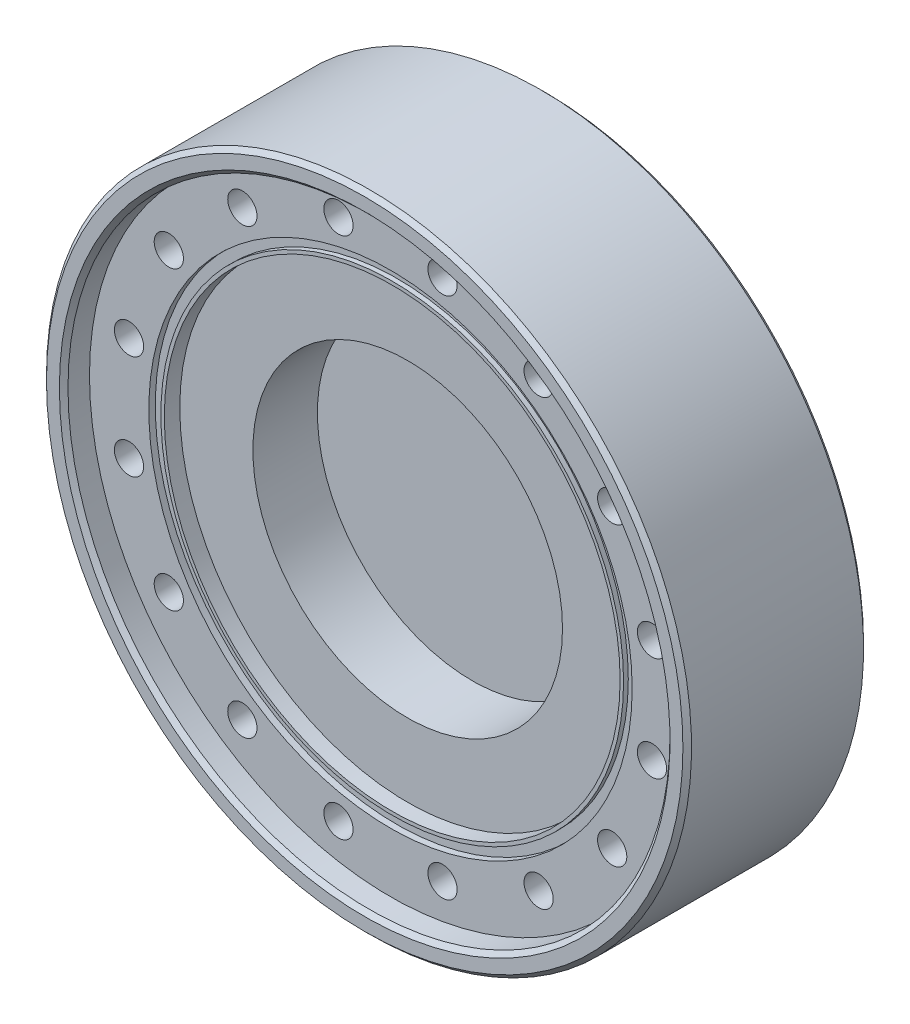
ISO-10303-21;
HEADER;
FILE_DESCRIPTION(('STEP AP214'),'2;1');
FILE_NAME('part.step','',(''),(''),'','','');
FILE_SCHEMA(('AUTOMOTIVE_DESIGN { 1 0 10303 214 1 1 1 1 }'));
ENDSEC;
DATA;
#1=APPLICATION_CONTEXT('core data for automotive mechanical design processes');
#2=APPLICATION_PROTOCOL_DEFINITION('international standard','automotive_design',2000,#1);
#3=PRODUCT_CONTEXT('',#1,'mechanical');
#4=PRODUCT('Part','Part','',(#3));
#5=PRODUCT_RELATED_PRODUCT_CATEGORY('part','',(#4));
#6=PRODUCT_DEFINITION_FORMATION('','',#4);
#7=PRODUCT_DEFINITION_CONTEXT('part definition',#1,'design');
#8=PRODUCT_DEFINITION('design','',#6,#7);
#9=PRODUCT_DEFINITION_SHAPE('','',#8);
#10=(LENGTH_UNIT() NAMED_UNIT(*) SI_UNIT(.MILLI.,.METRE.));
#11=(NAMED_UNIT(*) PLANE_ANGLE_UNIT() SI_UNIT($,.RADIAN.));
#12=(NAMED_UNIT(*) SI_UNIT($,.STERADIAN.) SOLID_ANGLE_UNIT());
#13=UNCERTAINTY_MEASURE_WITH_UNIT(LENGTH_MEASURE(1.E-05),#10,'distance_accuracy_value','');
#14=(GEOMETRIC_REPRESENTATION_CONTEXT(3) GLOBAL_UNCERTAINTY_ASSIGNED_CONTEXT((#13)) GLOBAL_UNIT_ASSIGNED_CONTEXT((#10,
#11,#12)) REPRESENTATION_CONTEXT('',''));
#15=CARTESIAN_POINT('',(0.,0.,0.));
#16=DIRECTION('',(0.,0.,1.));
#17=DIRECTION('',(1.,0.,0.));
#18=AXIS2_PLACEMENT_3D('',#15,#16,#17);
#19=CARTESIAN_POINT('',(0.,0.,-3.75));
#20=DIRECTION('',(0.,0.,1.));
#21=DIRECTION('',(1.,0.,0.));
#22=AXIS2_PLACEMENT_3D('',#19,#20,#21);
#23=CYLINDRICAL_SURFACE('',#22,26.9);
#24=CARTESIAN_POINT('',(0.,0.,-3.75));
#25=DIRECTION('',(0.,0.,1.));
#26=DIRECTION('',(1.,0.,0.));
#27=AXIS2_PLACEMENT_3D('',#24,#25,#26);
#28=CIRCLE('',#27,26.9);
#29=CARTESIAN_POINT('',(26.9,0.,-3.75));
#30=VERTEX_POINT('',#29);
#31=EDGE_CURVE('E473',#30,#30,#28,.T.);
#32=ORIENTED_EDGE('',*,*,#31,.T.);
#33=EDGE_LOOP('',(#32));
#34=FACE_BOUND('',#33,.T.);
#35=CARTESIAN_POINT('',(0.,0.,-3.2));
#36=DIRECTION('',(0.,0.,1.));
#37=DIRECTION('',(1.,0.,0.));
#38=AXIS2_PLACEMENT_3D('',#35,#36,#37);
#39=CIRCLE('',#38,26.9);
#40=CARTESIAN_POINT('',(26.9,0.,-3.2));
#41=VERTEX_POINT('',#40);
#42=EDGE_CURVE('E416',#41,#41,#39,.T.);
#43=ORIENTED_EDGE('',*,*,#42,.F.);
#44=EDGE_LOOP('',(#43));
#45=FACE_BOUND('',#44,.T.);
#46=ADVANCED_FACE('F55',(#34,#45),#23,.T.);
#47=CARTESIAN_POINT('',(0.,37.5,-21.));
#48=DIRECTION('',(0.,0.,1.));
#49=DIRECTION('',(1.,0.,0.));
#50=AXIS2_PLACEMENT_3D('',#47,#48,#49);
#51=PLANE('',#50);
#52=CARTESIAN_POINT('',(0.,0.,-21.));
#53=DIRECTION('',(0.,0.,1.));
#54=DIRECTION('',(1.,0.,0.));
#55=AXIS2_PLACEMENT_3D('',#52,#53,#54);
#56=CIRCLE('',#55,9.50000000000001);
#57=CARTESIAN_POINT('',(9.50000000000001,0.,-21.));
#58=VERTEX_POINT('',#57);
#59=EDGE_CURVE('E436',#58,#58,#56,.T.);
#60=ORIENTED_EDGE('',*,*,#59,.T.);
#61=EDGE_LOOP('',(#60));
#62=FACE_BOUND('',#61,.T.);
#63=CARTESIAN_POINT('',(30.4043436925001,-6.04779998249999,-21.));
#64=DIRECTION('',(0.,0.,-1.));
#65=DIRECTION('',(-1.,0.,0.));
#66=AXIS2_PLACEMENT_3D('',#63,#64,#65);
#67=CIRCLE('',#66,3.);
#68=CARTESIAN_POINT('',(27.4043436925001,-6.04779998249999,-21.));
#69=VERTEX_POINT('',#68);
#70=EDGE_CURVE('E235',#69,#69,#67,.T.);
#71=ORIENTED_EDGE('',*,*,#70,.F.);
#72=EDGE_LOOP('',(#71));
#73=FACE_BOUND('',#72,.T.);
#74=CARTESIAN_POINT('',(-25.7755579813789,-17.2226772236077,-21.));
#75=DIRECTION('',(0.,0.,-1.));
#76=DIRECTION('',(-1.,0.,0.));
#77=AXIS2_PLACEMENT_3D('',#74,#75,#76);
#78=CIRCLE('',#77,3.);
#79=CARTESIAN_POINT('',(-28.7755579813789,-17.2226772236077,-21.));
#80=VERTEX_POINT('',#79);
#81=EDGE_CURVE('E295',#80,#80,#78,.T.);
#82=ORIENTED_EDGE('',*,*,#81,.F.);
#83=EDGE_LOOP('',(#82));
#84=FACE_BOUND('',#83,.T.);
#85=CARTESIAN_POINT('',(-30.4043436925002,-6.04779998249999,-21.));
#86=DIRECTION('',(0.,0.,-1.));
#87=DIRECTION('',(-1.,0.,0.));
#88=AXIS2_PLACEMENT_3D('',#85,#86,#87);
#89=CIRCLE('',#88,3.);
#90=CARTESIAN_POINT('',(-33.4043436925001,-6.04779998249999,-21.));
#91=VERTEX_POINT('',#90);
#92=EDGE_CURVE('E305',#91,#91,#89,.T.);
#93=ORIENTED_EDGE('',*,*,#92,.F.);
#94=EDGE_LOOP('',(#93));
#95=FACE_BOUND('',#94,.T.);
#96=CARTESIAN_POINT('',(-30.4043436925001,6.04779998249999,-21.));
#97=DIRECTION('',(0.,0.,-1.));
#98=DIRECTION('',(-1.,0.,0.));
#99=AXIS2_PLACEMENT_3D('',#96,#97,#98);
#100=CIRCLE('',#99,3.);
#101=CARTESIAN_POINT('',(-33.4043436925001,6.04779998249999,-21.));
#102=VERTEX_POINT('',#101);
#103=EDGE_CURVE('E315',#102,#102,#100,.T.);
#104=ORIENTED_EDGE('',*,*,#103,.F.);
#105=EDGE_LOOP('',(#104));
#106=FACE_BOUND('',#105,.T.);
#107=CARTESIAN_POINT('',(22.5,0.,-21.));
#108=DIRECTION('',(0.,0.,-1.));
#109=DIRECTION('',(-1.,0.,0.));
#110=AXIS2_PLACEMENT_3D('',#107,#108,#109);
#111=CIRCLE('',#110,2.);
#112=CARTESIAN_POINT('',(20.5,0.,-21.));
#113=VERTEX_POINT('',#112);
#114=EDGE_CURVE('E325',#113,#113,#111,.T.);
#115=ORIENTED_EDGE('',*,*,#114,.F.);
#116=EDGE_LOOP('',(#115));
#117=FACE_BOUND('',#116,.T.);
#118=CARTESIAN_POINT('',(19.4855715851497,11.2500000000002,-21.));
#119=DIRECTION('',(0.,0.,-1.));
#120=DIRECTION('',(-1.,0.,0.));
#121=AXIS2_PLACEMENT_3D('',#118,#119,#120);
#122=CIRCLE('',#121,2.5);
#123=CARTESIAN_POINT('',(16.9855715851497,11.2500000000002,-21.));
#124=VERTEX_POINT('',#123);
#125=EDGE_CURVE('E331',#124,#124,#122,.T.);
#126=ORIENTED_EDGE('',*,*,#125,.F.);
#127=EDGE_LOOP('',(#126));
#128=FACE_BOUND('',#127,.T.);
#129=CARTESIAN_POINT('',(19.48557158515,-11.2499999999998,-21.));
#130=DIRECTION('',(0.,0.,-1.));
#131=DIRECTION('',(-1.,0.,0.));
#132=AXIS2_PLACEMENT_3D('',#129,#130,#131);
#133=CIRCLE('',#132,2.5);
#134=CARTESIAN_POINT('',(16.98557158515,-11.2499999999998,-21.));
#135=VERTEX_POINT('',#134);
#136=EDGE_CURVE('E337',#135,#135,#133,.T.);
#137=ORIENTED_EDGE('',*,*,#136,.F.);
#138=EDGE_LOOP('',(#137));
#139=FACE_BOUND('',#138,.T.);
#140=CARTESIAN_POINT('',(0.,-22.5,-21.));
#141=DIRECTION('',(0.,0.,-1.));
#142=DIRECTION('',(-1.,0.,0.));
#143=AXIS2_PLACEMENT_3D('',#140,#141,#142);
#144=CIRCLE('',#143,2.5);
#145=CARTESIAN_POINT('',(-2.5,-22.5,-21.));
#146=VERTEX_POINT('',#145);
#147=EDGE_CURVE('E343',#146,#146,#144,.T.);
#148=ORIENTED_EDGE('',*,*,#147,.F.);
#149=EDGE_LOOP('',(#148));
#150=FACE_BOUND('',#149,.T.);
#151=CARTESIAN_POINT('',(-19.4855715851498,-11.2500000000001,-21.));
#152=DIRECTION('',(0.,0.,-1.));
#153=DIRECTION('',(-1.,0.,0.));
#154=AXIS2_PLACEMENT_3D('',#151,#152,#153);
#155=CIRCLE('',#154,2.5);
#156=CARTESIAN_POINT('',(-21.9855715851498,-11.2500000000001,-21.));
#157=VERTEX_POINT('',#156);
#158=EDGE_CURVE('E349',#157,#157,#155,.T.);
#159=ORIENTED_EDGE('',*,*,#158,.F.);
#160=EDGE_LOOP('',(#159));
#161=FACE_BOUND('',#160,.T.);
#162=CARTESIAN_POINT('',(-19.4855715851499,11.25,-21.));
#163=DIRECTION('',(0.,0.,-1.));
#164=DIRECTION('',(-1.,0.,0.));
#165=AXIS2_PLACEMENT_3D('',#162,#163,#164);
#166=CIRCLE('',#165,2.5);
#167=CARTESIAN_POINT('',(-21.9855715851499,11.25,-21.));
#168=VERTEX_POINT('',#167);
#169=EDGE_CURVE('E355',#168,#168,#166,.T.);
#170=ORIENTED_EDGE('',*,*,#169,.F.);
#171=EDGE_LOOP('',(#170));
#172=FACE_BOUND('',#171,.T.);
#173=CARTESIAN_POINT('',(0.,22.5,-21.));
#174=DIRECTION('',(0.,0.,-1.));
#175=DIRECTION('',(-1.,0.,0.));
#176=AXIS2_PLACEMENT_3D('',#173,#174,#175);
#177=CIRCLE('',#176,2.5);
#178=CARTESIAN_POINT('',(-2.5,22.5,-21.));
#179=VERTEX_POINT('',#178);
#180=EDGE_CURVE('E361',#179,#179,#177,.T.);
#181=ORIENTED_EDGE('',*,*,#180,.F.);
#182=EDGE_LOOP('',(#181));
#183=FACE_BOUND('',#182,.T.);
#184=DIRECTION('',(1.,0.,0.));
#185=VECTOR('',#184,1.);
#186=CARTESIAN_POINT('',(-34.,3.,-21.));
#187=LINE('',#186,#185);
#188=CARTESIAN_POINT('',(-36.8781778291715,3.,-21.));
#189=VERTEX_POINT('',#188);
#190=CARTESIAN_POINT('',(-34.,3.,-21.));
#191=VERTEX_POINT('',#190);
#192=EDGE_CURVE('E147',#189,#191,#187,.T.);
#193=ORIENTED_EDGE('',*,*,#192,.F.);
#194=CARTESIAN_POINT('',(0.,0.,-21.));
#195=DIRECTION('',(0.,0.,1.));
#196=DIRECTION('',(1.,0.,0.));
#197=AXIS2_PLACEMENT_3D('',#194,#195,#196);
#198=CIRCLE('',#197,37.);
#199=CARTESIAN_POINT('',(-36.8781778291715,-3.,-21.));
#200=VERTEX_POINT('',#199);
#201=EDGE_CURVE('E70',#189,#200,#198,.F.);
#202=ORIENTED_EDGE('',*,*,#201,.T.);
#203=DIRECTION('',(-1.,0.,0.));
#204=VECTOR('',#203,1.);
#205=CARTESIAN_POINT('',(-34.,-3.,-21.));
#206=LINE('',#205,#204);
#207=CARTESIAN_POINT('',(-34.,-3.,-21.));
#208=VERTEX_POINT('',#207);
#209=EDGE_CURVE('E149',#208,#200,#206,.T.);
#210=ORIENTED_EDGE('',*,*,#209,.F.);
#211=CARTESIAN_POINT('',(-34.,0.,-21.));
#212=DIRECTION('',(0.,0.,-1.));
#213=DIRECTION('',(-1.,0.,0.));
#214=AXIS2_PLACEMENT_3D('',#211,#212,#213);
#215=CIRCLE('',#214,3.);
#216=EDGE_CURVE('E132',#191,#208,#215,.T.);
#217=ORIENTED_EDGE('',*,*,#216,.F.);
#218=EDGE_LOOP('',(#193,#202,#210,#217));
#219=FACE_BOUND('',#218,.T.);
#220=CARTESIAN_POINT('',(-17.2226772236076,-25.7755579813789,-21.));
#221=DIRECTION('',(0.,0.,-1.));
#222=DIRECTION('',(-1.,0.,0.));
#223=AXIS2_PLACEMENT_3D('',#220,#221,#222);
#224=CIRCLE('',#223,3.);
#225=CARTESIAN_POINT('',(-20.2226772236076,-25.7755579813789,-21.));
#226=VERTEX_POINT('',#225);
#227=EDGE_CURVE('E285',#226,#226,#224,.T.);
#228=ORIENTED_EDGE('',*,*,#227,.F.);
#229=EDGE_LOOP('',(#228));
#230=FACE_BOUND('',#229,.T.);
#231=CARTESIAN_POINT('',(-6.04779998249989,-30.4043436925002,-21.));
#232=DIRECTION('',(0.,0.,-1.));
#233=DIRECTION('',(-1.,0.,0.));
#234=AXIS2_PLACEMENT_3D('',#231,#232,#233);
#235=CIRCLE('',#234,3.);
#236=CARTESIAN_POINT('',(-9.04779998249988,-30.4043436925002,-21.));
#237=VERTEX_POINT('',#236);
#238=EDGE_CURVE('E275',#237,#237,#235,.T.);
#239=ORIENTED_EDGE('',*,*,#238,.F.);
#240=EDGE_LOOP('',(#239));
#241=FACE_BOUND('',#240,.T.);
#242=CARTESIAN_POINT('',(6.0477999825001,-30.4043436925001,-21.));
#243=DIRECTION('',(0.,0.,-1.));
#244=DIRECTION('',(-1.,0.,0.));
#245=AXIS2_PLACEMENT_3D('',#242,#243,#244);
#246=CIRCLE('',#245,3.);
#247=CARTESIAN_POINT('',(3.0477999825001,-30.4043436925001,-21.));
#248=VERTEX_POINT('',#247);
#249=EDGE_CURVE('E265',#248,#248,#246,.T.);
#250=ORIENTED_EDGE('',*,*,#249,.F.);
#251=EDGE_LOOP('',(#250));
#252=FACE_BOUND('',#251,.T.);
#253=CARTESIAN_POINT('',(17.2226772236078,-25.7755579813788,-21.));
#254=DIRECTION('',(0.,0.,-1.));
#255=DIRECTION('',(-1.,0.,0.));
#256=AXIS2_PLACEMENT_3D('',#253,#254,#255);
#257=CIRCLE('',#256,3.);
#258=CARTESIAN_POINT('',(14.2226772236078,-25.7755579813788,-21.));
#259=VERTEX_POINT('',#258);
#260=EDGE_CURVE('E255',#259,#259,#257,.T.);
#261=ORIENTED_EDGE('',*,*,#260,.F.);
#262=EDGE_LOOP('',(#261));
#263=FACE_BOUND('',#262,.T.);
#264=CARTESIAN_POINT('',(25.775557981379,-17.2226772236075,-21.));
#265=DIRECTION('',(0.,0.,-1.));
#266=DIRECTION('',(-1.,0.,0.));
#267=AXIS2_PLACEMENT_3D('',#264,#265,#266);
#268=CIRCLE('',#267,3.);
#269=CARTESIAN_POINT('',(22.775557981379,-17.2226772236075,-21.));
#270=VERTEX_POINT('',#269);
#271=EDGE_CURVE('E245',#270,#270,#268,.T.);
#272=ORIENTED_EDGE('',*,*,#271,.F.);
#273=EDGE_LOOP('',(#272));
#274=FACE_BOUND('',#273,.T.);
#275=CARTESIAN_POINT('',(30.4043436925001,6.0477999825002,-21.));
#276=DIRECTION('',(0.,0.,-1.));
#277=DIRECTION('',(-1.,0.,0.));
#278=AXIS2_PLACEMENT_3D('',#275,#276,#277);
#279=CIRCLE('',#278,3.);
#280=CARTESIAN_POINT('',(27.4043436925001,6.0477999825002,-21.));
#281=VERTEX_POINT('',#280);
#282=EDGE_CURVE('E225',#281,#281,#279,.T.);
#283=ORIENTED_EDGE('',*,*,#282,.F.);
#284=EDGE_LOOP('',(#283));
#285=FACE_BOUND('',#284,.T.);
#286=CARTESIAN_POINT('',(25.7755579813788,17.2226772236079,-21.));
#287=DIRECTION('',(0.,0.,-1.));
#288=DIRECTION('',(-1.,0.,0.));
#289=AXIS2_PLACEMENT_3D('',#286,#287,#288);
#290=CIRCLE('',#289,3.);
#291=CARTESIAN_POINT('',(22.7755579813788,17.2226772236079,-21.));
#292=VERTEX_POINT('',#291);
#293=EDGE_CURVE('E215',#292,#292,#290,.T.);
#294=ORIENTED_EDGE('',*,*,#293,.F.);
#295=EDGE_LOOP('',(#294));
#296=FACE_BOUND('',#295,.T.);
#297=CARTESIAN_POINT('',(17.2226772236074,25.7755579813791,-21.));
#298=DIRECTION('',(0.,0.,-1.));
#299=DIRECTION('',(-1.,0.,0.));
#300=AXIS2_PLACEMENT_3D('',#297,#298,#299);
#301=CIRCLE('',#300,3.);
#302=CARTESIAN_POINT('',(14.2226772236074,25.7755579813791,-21.));
#303=VERTEX_POINT('',#302);
#304=EDGE_CURVE('E205',#303,#303,#301,.T.);
#305=ORIENTED_EDGE('',*,*,#304,.F.);
#306=EDGE_LOOP('',(#305));
#307=FACE_BOUND('',#306,.T.);
#308=CARTESIAN_POINT('',(6.04779998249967,30.4043436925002,-21.));
#309=DIRECTION('',(0.,0.,-1.));
#310=DIRECTION('',(-1.,0.,0.));
#311=AXIS2_PLACEMENT_3D('',#308,#309,#310);
#312=CIRCLE('',#311,3.);
#313=CARTESIAN_POINT('',(3.04779998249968,30.4043436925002,-21.));
#314=VERTEX_POINT('',#313);
#315=EDGE_CURVE('E195',#314,#314,#312,.T.);
#316=ORIENTED_EDGE('',*,*,#315,.F.);
#317=EDGE_LOOP('',(#316));
#318=FACE_BOUND('',#317,.T.);
#319=CARTESIAN_POINT('',(-6.04779998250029,30.4043436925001,-21.));
#320=DIRECTION('',(0.,0.,-1.));
#321=DIRECTION('',(-1.,0.,0.));
#322=AXIS2_PLACEMENT_3D('',#319,#320,#321);
#323=CIRCLE('',#322,3.);
#324=CARTESIAN_POINT('',(-9.04779998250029,30.4043436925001,-21.));
#325=VERTEX_POINT('',#324);
#326=EDGE_CURVE('E185',#325,#325,#323,.T.);
#327=ORIENTED_EDGE('',*,*,#326,.F.);
#328=EDGE_LOOP('',(#327));
#329=FACE_BOUND('',#328,.T.);
#330=CARTESIAN_POINT('',(-17.222677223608,25.7755579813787,-21.));
#331=DIRECTION('',(0.,0.,-1.));
#332=DIRECTION('',(-1.,0.,0.));
#333=AXIS2_PLACEMENT_3D('',#330,#331,#332);
#334=CIRCLE('',#333,3.);
#335=CARTESIAN_POINT('',(-20.222677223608,25.7755579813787,-21.));
#336=VERTEX_POINT('',#335);
#337=EDGE_CURVE('E175',#336,#336,#334,.T.);
#338=ORIENTED_EDGE('',*,*,#337,.F.);
#339=EDGE_LOOP('',(#338));
#340=FACE_BOUND('',#339,.T.);
#341=CARTESIAN_POINT('',(-25.7755579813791,17.2226772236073,-21.));
#342=DIRECTION('',(0.,0.,-1.));
#343=DIRECTION('',(-1.,0.,0.));
#344=AXIS2_PLACEMENT_3D('',#341,#342,#343);
#345=CIRCLE('',#344,3.);
#346=CARTESIAN_POINT('',(-28.7755579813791,17.2226772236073,-21.));
#347=VERTEX_POINT('',#346);
#348=EDGE_CURVE('E162',#347,#347,#345,.T.);
#349=ORIENTED_EDGE('',*,*,#348,.F.);
#350=EDGE_LOOP('',(#349));
#351=FACE_BOUND('',#350,.T.);
#352=ADVANCED_FACE('F457',(#62,#73,#84,#95,#106,#117,#128,#139,#150,#161,#172,#183,#219,#230,
#241,#252,#263,#274,#285,#296,#307,#318,#329,#340,#351),#51,.F.);
#353=CARTESIAN_POINT('',(0.,35.,-3.));
#354=DIRECTION('',(0.,0.,-1.));
#355=DIRECTION('',(-1.,0.,0.));
#356=AXIS2_PLACEMENT_3D('',#353,#354,#355);
#357=PLANE('',#356);
#358=CARTESIAN_POINT('',(0.,0.,-3.));
#359=DIRECTION('',(0.,0.,1.));
#360=DIRECTION('',(1.,0.,0.));
#361=AXIS2_PLACEMENT_3D('',#358,#359,#360);
#362=CIRCLE('',#361,28.1);
#363=CARTESIAN_POINT('',(28.1,0.,-3.));
#364=VERTEX_POINT('',#363);
#365=EDGE_CURVE('E152',#364,#364,#362,.T.);
#366=ORIENTED_EDGE('',*,*,#365,.F.);
#367=EDGE_LOOP('',(#366));
#368=FACE_BOUND('',#367,.T.);
#369=CARTESIAN_POINT('',(-25.7755579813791,17.2226772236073,-3.));
#370=DIRECTION('',(0.,0.,-1.));
#371=DIRECTION('',(-1.,0.,0.));
#372=AXIS2_PLACEMENT_3D('',#369,#370,#371);
#373=CIRCLE('',#372,1.7);
#374=CARTESIAN_POINT('',(-27.4755579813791,17.2226772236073,-3.));
#375=VERTEX_POINT('',#374);
#376=EDGE_CURVE('E174',#375,#375,#373,.T.);
#377=ORIENTED_EDGE('',*,*,#376,.T.);
#378=EDGE_LOOP('',(#377));
#379=FACE_BOUND('',#378,.T.);
#380=CARTESIAN_POINT('',(-17.222677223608,25.7755579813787,-3.));
#381=DIRECTION('',(0.,0.,-1.));
#382=DIRECTION('',(-1.,0.,0.));
#383=AXIS2_PLACEMENT_3D('',#380,#381,#382);
#384=CIRCLE('',#383,1.7);
#385=CARTESIAN_POINT('',(-18.922677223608,25.7755579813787,-3.));
#386=VERTEX_POINT('',#385);
#387=EDGE_CURVE('E184',#386,#386,#384,.T.);
#388=ORIENTED_EDGE('',*,*,#387,.T.);
#389=EDGE_LOOP('',(#388));
#390=FACE_BOUND('',#389,.T.);
#391=CARTESIAN_POINT('',(-6.04779998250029,30.4043436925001,-3.));
#392=DIRECTION('',(0.,0.,-1.));
#393=DIRECTION('',(-1.,0.,0.));
#394=AXIS2_PLACEMENT_3D('',#391,#392,#393);
#395=CIRCLE('',#394,1.7);
#396=CARTESIAN_POINT('',(-7.74779998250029,30.4043436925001,-3.));
#397=VERTEX_POINT('',#396);
#398=EDGE_CURVE('E194',#397,#397,#395,.T.);
#399=ORIENTED_EDGE('',*,*,#398,.T.);
#400=EDGE_LOOP('',(#399));
#401=FACE_BOUND('',#400,.T.);
#402=CARTESIAN_POINT('',(6.04779998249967,30.4043436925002,-3.));
#403=DIRECTION('',(0.,0.,-1.));
#404=DIRECTION('',(-1.,0.,0.));
#405=AXIS2_PLACEMENT_3D('',#402,#403,#404);
#406=CIRCLE('',#405,1.7);
#407=CARTESIAN_POINT('',(4.34779998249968,30.4043436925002,-3.));
#408=VERTEX_POINT('',#407);
#409=EDGE_CURVE('E204',#408,#408,#406,.T.);
#410=ORIENTED_EDGE('',*,*,#409,.T.);
#411=EDGE_LOOP('',(#410));
#412=FACE_BOUND('',#411,.T.);
#413=CARTESIAN_POINT('',(17.2226772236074,25.7755579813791,-3.));
#414=DIRECTION('',(0.,0.,-1.));
#415=DIRECTION('',(-1.,0.,0.));
#416=AXIS2_PLACEMENT_3D('',#413,#414,#415);
#417=CIRCLE('',#416,1.7);
#418=CARTESIAN_POINT('',(15.5226772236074,25.7755579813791,-3.));
#419=VERTEX_POINT('',#418);
#420=EDGE_CURVE('E214',#419,#419,#417,.T.);
#421=ORIENTED_EDGE('',*,*,#420,.T.);
#422=EDGE_LOOP('',(#421));
#423=FACE_BOUND('',#422,.T.);
#424=CARTESIAN_POINT('',(25.7755579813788,17.2226772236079,-3.));
#425=DIRECTION('',(0.,0.,-1.));
#426=DIRECTION('',(-1.,0.,0.));
#427=AXIS2_PLACEMENT_3D('',#424,#425,#426);
#428=CIRCLE('',#427,1.7);
#429=CARTESIAN_POINT('',(24.0755579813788,17.2226772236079,-3.));
#430=VERTEX_POINT('',#429);
#431=EDGE_CURVE('E224',#430,#430,#428,.T.);
#432=ORIENTED_EDGE('',*,*,#431,.T.);
#433=EDGE_LOOP('',(#432));
#434=FACE_BOUND('',#433,.T.);
#435=CARTESIAN_POINT('',(30.4043436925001,6.0477999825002,-3.));
#436=DIRECTION('',(0.,0.,-1.));
#437=DIRECTION('',(-1.,0.,0.));
#438=AXIS2_PLACEMENT_3D('',#435,#436,#437);
#439=CIRCLE('',#438,1.7);
#440=CARTESIAN_POINT('',(28.7043436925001,6.0477999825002,-3.));
#441=VERTEX_POINT('',#440);
#442=EDGE_CURVE('E234',#441,#441,#439,.T.);
#443=ORIENTED_EDGE('',*,*,#442,.T.);
#444=EDGE_LOOP('',(#443));
#445=FACE_BOUND('',#444,.T.);
#446=CARTESIAN_POINT('',(30.4043436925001,-6.04779998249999,-3.));
#447=DIRECTION('',(0.,0.,-1.));
#448=DIRECTION('',(-1.,0.,0.));
#449=AXIS2_PLACEMENT_3D('',#446,#447,#448);
#450=CIRCLE('',#449,1.7);
#451=CARTESIAN_POINT('',(28.7043436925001,-6.04779998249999,-3.));
#452=VERTEX_POINT('',#451);
#453=EDGE_CURVE('E244',#452,#452,#450,.T.);
#454=ORIENTED_EDGE('',*,*,#453,.T.);
#455=EDGE_LOOP('',(#454));
#456=FACE_BOUND('',#455,.T.);
#457=CARTESIAN_POINT('',(25.775557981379,-17.2226772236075,-3.));
#458=DIRECTION('',(0.,0.,-1.));
#459=DIRECTION('',(-1.,0.,0.));
#460=AXIS2_PLACEMENT_3D('',#457,#458,#459);
#461=CIRCLE('',#460,1.7);
#462=CARTESIAN_POINT('',(24.075557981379,-17.2226772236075,-3.));
#463=VERTEX_POINT('',#462);
#464=EDGE_CURVE('E254',#463,#463,#461,.T.);
#465=ORIENTED_EDGE('',*,*,#464,.T.);
#466=EDGE_LOOP('',(#465));
#467=FACE_BOUND('',#466,.T.);
#468=CARTESIAN_POINT('',(17.2226772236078,-25.7755579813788,-3.));
#469=DIRECTION('',(0.,0.,-1.));
#470=DIRECTION('',(-1.,0.,0.));
#471=AXIS2_PLACEMENT_3D('',#468,#469,#470);
#472=CIRCLE('',#471,1.7);
#473=CARTESIAN_POINT('',(15.5226772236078,-25.7755579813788,-3.));
#474=VERTEX_POINT('',#473);
#475=EDGE_CURVE('E264',#474,#474,#472,.T.);
#476=ORIENTED_EDGE('',*,*,#475,.T.);
#477=EDGE_LOOP('',(#476));
#478=FACE_BOUND('',#477,.T.);
#479=CARTESIAN_POINT('',(6.0477999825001,-30.4043436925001,-3.));
#480=DIRECTION('',(0.,0.,-1.));
#481=DIRECTION('',(-1.,0.,0.));
#482=AXIS2_PLACEMENT_3D('',#479,#480,#481);
#483=CIRCLE('',#482,1.7);
#484=CARTESIAN_POINT('',(4.3477999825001,-30.4043436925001,-3.));
#485=VERTEX_POINT('',#484);
#486=EDGE_CURVE('E274',#485,#485,#483,.T.);
#487=ORIENTED_EDGE('',*,*,#486,.T.);
#488=EDGE_LOOP('',(#487));
#489=FACE_BOUND('',#488,.T.);
#490=CARTESIAN_POINT('',(-6.04779998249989,-30.4043436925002,-3.));
#491=DIRECTION('',(0.,0.,-1.));
#492=DIRECTION('',(-1.,0.,0.));
#493=AXIS2_PLACEMENT_3D('',#490,#491,#492);
#494=CIRCLE('',#493,1.7);
#495=CARTESIAN_POINT('',(-7.74779998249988,-30.4043436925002,-3.));
#496=VERTEX_POINT('',#495);
#497=EDGE_CURVE('E284',#496,#496,#494,.T.);
#498=ORIENTED_EDGE('',*,*,#497,.T.);
#499=EDGE_LOOP('',(#498));
#500=FACE_BOUND('',#499,.T.);
#501=CARTESIAN_POINT('',(-17.2226772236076,-25.7755579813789,-3.));
#502=DIRECTION('',(0.,0.,-1.));
#503=DIRECTION('',(-1.,0.,0.));
#504=AXIS2_PLACEMENT_3D('',#501,#502,#503);
#505=CIRCLE('',#504,1.7);
#506=CARTESIAN_POINT('',(-18.9226772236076,-25.7755579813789,-3.));
#507=VERTEX_POINT('',#506);
#508=EDGE_CURVE('E294',#507,#507,#505,.T.);
#509=ORIENTED_EDGE('',*,*,#508,.T.);
#510=EDGE_LOOP('',(#509));
#511=FACE_BOUND('',#510,.T.);
#512=CARTESIAN_POINT('',(-25.7755579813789,-17.2226772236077,-3.));
#513=DIRECTION('',(0.,0.,-1.));
#514=DIRECTION('',(-1.,0.,0.));
#515=AXIS2_PLACEMENT_3D('',#512,#513,#514);
#516=CIRCLE('',#515,1.7);
#517=CARTESIAN_POINT('',(-27.4755579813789,-17.2226772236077,-3.));
#518=VERTEX_POINT('',#517);
#519=EDGE_CURVE('E304',#518,#518,#516,.T.);
#520=ORIENTED_EDGE('',*,*,#519,.T.);
#521=EDGE_LOOP('',(#520));
#522=FACE_BOUND('',#521,.T.);
#523=CARTESIAN_POINT('',(-30.4043436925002,-6.04779998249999,-3.));
#524=DIRECTION('',(0.,0.,-1.));
#525=DIRECTION('',(-1.,0.,0.));
#526=AXIS2_PLACEMENT_3D('',#523,#524,#525);
#527=CIRCLE('',#526,1.7);
#528=CARTESIAN_POINT('',(-32.1043436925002,-6.04779998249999,-3.));
#529=VERTEX_POINT('',#528);
#530=EDGE_CURVE('E314',#529,#529,#527,.T.);
#531=ORIENTED_EDGE('',*,*,#530,.T.);
#532=EDGE_LOOP('',(#531));
#533=FACE_BOUND('',#532,.T.);
#534=CARTESIAN_POINT('',(-30.4043436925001,6.04779998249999,-3.));
#535=DIRECTION('',(0.,0.,-1.));
#536=DIRECTION('',(-1.,0.,0.));
#537=AXIS2_PLACEMENT_3D('',#534,#535,#536);
#538=CIRCLE('',#537,1.7);
#539=CARTESIAN_POINT('',(-32.1043436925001,6.04779998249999,-3.));
#540=VERTEX_POINT('',#539);
#541=EDGE_CURVE('E324',#540,#540,#538,.T.);
#542=ORIENTED_EDGE('',*,*,#541,.T.);
#543=EDGE_LOOP('',(#542));
#544=FACE_BOUND('',#543,.T.);
#545=CARTESIAN_POINT('',(0.,0.,-3.));
#546=DIRECTION('',(0.,0.,1.));
#547=DIRECTION('',(1.,0.,0.));
#548=AXIS2_PLACEMENT_3D('',#545,#546,#547);
#549=CIRCLE('',#548,35.);
#550=CARTESIAN_POINT('',(35.,0.,-3.));
#551=VERTEX_POINT('',#550);
#552=EDGE_CURVE('E367',#551,#551,#549,.T.);
#553=ORIENTED_EDGE('',*,*,#552,.T.);
#554=EDGE_LOOP('',(#553));
#555=FACE_BOUND('',#554,.T.);
#556=ADVANCED_FACE('F486',(#368,#379,#390,#401,#412,#423,#434,#445,#456,#467,#478,#489,#500,
#511,#522,#533,#544,#555),#357,.F.);
#557=CARTESIAN_POINT('',(0.,0.,0.));
#558=DIRECTION('',(0.,0.,1.));
#559=DIRECTION('',(1.,0.,0.));
#560=AXIS2_PLACEMENT_3D('',#557,#558,#559);
#561=CYLINDRICAL_SURFACE('',#560,35.);
#562=CARTESIAN_POINT('',(0.,0.,-0.500000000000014));
#563=DIRECTION('',(0.,0.,-1.));
#564=DIRECTION('',(-1.,0.,0.));
#565=AXIS2_PLACEMENT_3D('',#562,#563,#564);
#566=CIRCLE('',#565,35.);
#567=CARTESIAN_POINT('',(-35.,0.,-0.500000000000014));
#568=VERTEX_POINT('',#567);
#569=EDGE_CURVE('E379',#568,#568,#566,.F.);
#570=ORIENTED_EDGE('',*,*,#569,.T.);
#571=EDGE_LOOP('',(#570));
#572=FACE_BOUND('',#571,.T.);
#573=ORIENTED_EDGE('',*,*,#552,.F.);
#574=EDGE_LOOP('',(#573));
#575=FACE_BOUND('',#574,.T.);
#576=ADVANCED_FACE('F489',(#572,#575),#561,.F.);
#577=CARTESIAN_POINT('',(0.,35.,0.));
#578=DIRECTION('',(0.,0.,-1.));
#579=DIRECTION('',(-1.,0.,0.));
#580=AXIS2_PLACEMENT_3D('',#577,#578,#579);
#581=PLANE('',#580);
#582=CARTESIAN_POINT('',(0.,0.,0.));
#583=DIRECTION('',(0.,0.,-1.));
#584=DIRECTION('',(-1.,0.,0.));
#585=AXIS2_PLACEMENT_3D('',#582,#583,#584);
#586=CIRCLE('',#585,35.5);
#587=CARTESIAN_POINT('',(-35.5,0.,0.));
#588=VERTEX_POINT('',#587);
#589=EDGE_CURVE('E422',#588,#588,#586,.T.);
#590=ORIENTED_EDGE('',*,*,#589,.T.);
#591=EDGE_LOOP('',(#590));
#592=FACE_BOUND('',#591,.T.);
#593=CARTESIAN_POINT('',(0.,0.,0.));
#594=DIRECTION('',(0.,0.,-1.));
#595=DIRECTION('',(-1.,0.,0.));
#596=AXIS2_PLACEMENT_3D('',#593,#594,#595);
#597=CIRCLE('',#596,37.);
#598=CARTESIAN_POINT('',(-37.,0.,0.));
#599=VERTEX_POINT('',#598);
#600=EDGE_CURVE('E419',#599,#599,#597,.F.);
#601=ORIENTED_EDGE('',*,*,#600,.T.);
#602=EDGE_LOOP('',(#601));
#603=FACE_BOUND('',#602,.T.);
#604=ADVANCED_FACE('F526',(#592,#603),#581,.F.);
#605=CARTESIAN_POINT('',(0.,0.,0.));
#606=DIRECTION('',(0.,0.,1.));
#607=DIRECTION('',(1.,0.,0.));
#608=AXIS2_PLACEMENT_3D('',#605,#606,#607);
#609=CYLINDRICAL_SURFACE('',#608,37.5);
#610=CARTESIAN_POINT('',(0.,0.,-0.500000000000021));
#611=DIRECTION('',(0.,0.,-1.));
#612=DIRECTION('',(-1.,0.,0.));
#613=AXIS2_PLACEMENT_3D('',#610,#611,#612);
#614=CIRCLE('',#613,37.5);
#615=CARTESIAN_POINT('',(-37.5,0.,-0.500000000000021));
#616=VERTEX_POINT('',#615);
#617=EDGE_CURVE('E428',#616,#616,#614,.T.);
#618=ORIENTED_EDGE('',*,*,#617,.T.);
#619=EDGE_LOOP('',(#618));
#620=FACE_BOUND('',#619,.T.);
#621=DIRECTION('',(0.,0.,-1.));
#622=VECTOR('',#621,1.);
#623=CARTESIAN_POINT('',(-37.3798073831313,-3.,-11.));
#624=LINE('',#623,#622);
#625=CARTESIAN_POINT('',(-37.3798073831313,-3.,-11.));
#626=VERTEX_POINT('',#625);
#627=CARTESIAN_POINT('',(-37.3798073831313,-3.,-20.5));
#628=VERTEX_POINT('',#627);
#629=EDGE_CURVE('E134',#626,#628,#624,.T.);
#630=ORIENTED_EDGE('',*,*,#629,.T.);
#631=CARTESIAN_POINT('',(0.,0.,-20.5));
#632=DIRECTION('',(0.,0.,1.));
#633=DIRECTION('',(1.,0.,0.));
#634=AXIS2_PLACEMENT_3D('',#631,#632,#633);
#635=CIRCLE('',#634,37.5);
#636=CARTESIAN_POINT('',(-37.3798073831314,3.,-20.5));
#637=VERTEX_POINT('',#636);
#638=EDGE_CURVE('E425',#628,#637,#635,.T.);
#639=ORIENTED_EDGE('',*,*,#638,.T.);
#640=DIRECTION('',(0.,0.,-1.));
#641=VECTOR('',#640,1.);
#642=CARTESIAN_POINT('',(-37.3798073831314,3.,-11.));
#643=LINE('',#642,#641);
#644=CARTESIAN_POINT('',(-37.3798073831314,3.,-11.));
#645=VERTEX_POINT('',#644);
#646=EDGE_CURVE('E163',#645,#637,#643,.T.);
#647=ORIENTED_EDGE('',*,*,#646,.F.);
#648=CARTESIAN_POINT('',(0.,0.,-11.));
#649=DIRECTION('',(0.,0.,-1.));
#650=DIRECTION('',(-1.,0.,0.));
#651=AXIS2_PLACEMENT_3D('',#648,#649,#650);
#652=CIRCLE('',#651,37.5);
#653=EDGE_CURVE('E143',#626,#645,#652,.T.);
#654=ORIENTED_EDGE('',*,*,#653,.F.);
#655=EDGE_LOOP('',(#630,#639,#647,#654));
#656=FACE_BOUND('',#655,.T.);
#657=ADVANCED_FACE('F532',(#620,#656),#609,.T.);
#658=CARTESIAN_POINT('',(0.,22.5,-8.));
#659=DIRECTION('',(0.,0.,-1.));
#660=DIRECTION('',(-1.,0.,0.));
#661=AXIS2_PLACEMENT_3D('',#658,#659,#660);
#662=CONICAL_SURFACE('',#661,2.5,1.02974425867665);
#663=CARTESIAN_POINT('',(0.,22.5,-6.4978484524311));
#664=VERTEX_POINT('',#663);
#665=VERTEX_LOOP('',#664);
#666=FACE_BOUND('',#665,.T.);
#667=CARTESIAN_POINT('',(0.,22.5,-8.));
#668=DIRECTION('',(0.,0.,-1.));
#669=DIRECTION('',(-1.,0.,0.));
#670=AXIS2_PLACEMENT_3D('',#667,#668,#669);
#671=CIRCLE('',#670,2.5);
#672=CARTESIAN_POINT('',(-2.5,22.5,-8.));
#673=VERTEX_POINT('',#672);
#674=EDGE_CURVE('E364',#673,#673,#671,.T.);
#675=ORIENTED_EDGE('',*,*,#674,.T.);
#676=EDGE_LOOP('',(#675));
#677=FACE_BOUND('',#676,.T.);
#678=ADVANCED_FACE('F1062',(#666,#677),#662,.F.);
#679=CARTESIAN_POINT('',(0.,22.5,-21.));
#680=DIRECTION('',(0.,0.,-1.));
#681=DIRECTION('',(-1.,0.,0.));
#682=AXIS2_PLACEMENT_3D('',#679,#680,#681);
#683=CYLINDRICAL_SURFACE('',#682,2.5);
#684=ORIENTED_EDGE('',*,*,#674,.F.);
#685=EDGE_LOOP('',(#684));
#686=FACE_BOUND('',#685,.T.);
#687=ORIENTED_EDGE('',*,*,#180,.T.);
#688=EDGE_LOOP('',(#687));
#689=FACE_BOUND('',#688,.T.);
#690=ADVANCED_FACE('F1054',(#686,#689),#683,.F.);
#691=CARTESIAN_POINT('',(-19.4855715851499,11.25,-8.));
#692=DIRECTION('',(0.,0.,-1.));
#693=DIRECTION('',(-1.,0.,0.));
#694=AXIS2_PLACEMENT_3D('',#691,#692,#693);
#695=CONICAL_SURFACE('',#694,2.5,1.02974425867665);
#696=CARTESIAN_POINT('',(-19.4855715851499,11.25,-6.4978484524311));
#697=VERTEX_POINT('',#696);
#698=VERTEX_LOOP('',#697);
#699=FACE_BOUND('',#698,.T.);
#700=CARTESIAN_POINT('',(-19.4855715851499,11.25,-8.));
#701=DIRECTION('',(0.,0.,-1.));
#702=DIRECTION('',(-1.,0.,0.));
#703=AXIS2_PLACEMENT_3D('',#700,#701,#702);
#704=CIRCLE('',#703,2.5);
#705=CARTESIAN_POINT('',(-21.9855715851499,11.25,-8.));
#706=VERTEX_POINT('',#705);
#707=EDGE_CURVE('E358',#706,#706,#704,.T.);
#708=ORIENTED_EDGE('',*,*,#707,.T.);
#709=EDGE_LOOP('',(#708));
#710=FACE_BOUND('',#709,.T.);
#711=ADVANCED_FACE('F1046',(#699,#710),#695,.F.);
#712=CARTESIAN_POINT('',(-19.4855715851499,11.25,-21.));
#713=DIRECTION('',(0.,0.,-1.));
#714=DIRECTION('',(-1.,0.,0.));
#715=AXIS2_PLACEMENT_3D('',#712,#713,#714);
#716=CYLINDRICAL_SURFACE('',#715,2.5);
#717=ORIENTED_EDGE('',*,*,#707,.F.);
#718=EDGE_LOOP('',(#717));
#719=FACE_BOUND('',#718,.T.);
#720=ORIENTED_EDGE('',*,*,#169,.T.);
#721=EDGE_LOOP('',(#720));
#722=FACE_BOUND('',#721,.T.);
#723=ADVANCED_FACE('F1038',(#719,#722),#716,.F.);
#724=CARTESIAN_POINT('',(-19.4855715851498,-11.2500000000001,-8.));
#725=DIRECTION('',(0.,0.,-1.));
#726=DIRECTION('',(-1.,0.,0.));
#727=AXIS2_PLACEMENT_3D('',#724,#725,#726);
#728=CONICAL_SURFACE('',#727,2.5,1.02974425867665);
#729=CARTESIAN_POINT('',(-19.4855715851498,-11.2500000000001,-6.4978484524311));
#730=VERTEX_POINT('',#729);
#731=VERTEX_LOOP('',#730);
#732=FACE_BOUND('',#731,.T.);
#733=CARTESIAN_POINT('',(-19.4855715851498,-11.2500000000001,-8.));
#734=DIRECTION('',(0.,0.,-1.));
#735=DIRECTION('',(-1.,0.,0.));
#736=AXIS2_PLACEMENT_3D('',#733,#734,#735);
#737=CIRCLE('',#736,2.5);
#738=CARTESIAN_POINT('',(-21.9855715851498,-11.2500000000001,-8.));
#739=VERTEX_POINT('',#738);
#740=EDGE_CURVE('E352',#739,#739,#737,.T.);
#741=ORIENTED_EDGE('',*,*,#740,.T.);
#742=EDGE_LOOP('',(#741));
#743=FACE_BOUND('',#742,.T.);
#744=ADVANCED_FACE('F1030',(#732,#743),#728,.F.);
#745=CARTESIAN_POINT('',(-19.4855715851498,-11.2500000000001,-21.));
#746=DIRECTION('',(0.,0.,-1.));
#747=DIRECTION('',(-1.,0.,0.));
#748=AXIS2_PLACEMENT_3D('',#745,#746,#747);
#749=CYLINDRICAL_SURFACE('',#748,2.5);
#750=ORIENTED_EDGE('',*,*,#740,.F.);
#751=EDGE_LOOP('',(#750));
#752=FACE_BOUND('',#751,.T.);
#753=ORIENTED_EDGE('',*,*,#158,.T.);
#754=EDGE_LOOP('',(#753));
#755=FACE_BOUND('',#754,.T.);
#756=ADVANCED_FACE('F1022',(#752,#755),#749,.F.);
#757=CARTESIAN_POINT('',(0.,-22.5,-8.));
#758=DIRECTION('',(0.,0.,-1.));
#759=DIRECTION('',(-1.,0.,0.));
#760=AXIS2_PLACEMENT_3D('',#757,#758,#759);
#761=CONICAL_SURFACE('',#760,2.5,1.02974425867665);
#762=CARTESIAN_POINT('',(0.,-22.5,-6.4978484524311));
#763=VERTEX_POINT('',#762);
#764=VERTEX_LOOP('',#763);
#765=FACE_BOUND('',#764,.T.);
#766=CARTESIAN_POINT('',(0.,-22.5,-8.));
#767=DIRECTION('',(0.,0.,-1.));
#768=DIRECTION('',(-1.,0.,0.));
#769=AXIS2_PLACEMENT_3D('',#766,#767,#768);
#770=CIRCLE('',#769,2.5);
#771=CARTESIAN_POINT('',(-2.5,-22.5,-8.));
#772=VERTEX_POINT('',#771);
#773=EDGE_CURVE('E346',#772,#772,#770,.T.);
#774=ORIENTED_EDGE('',*,*,#773,.T.);
#775=EDGE_LOOP('',(#774));
#776=FACE_BOUND('',#775,.T.);
#777=ADVANCED_FACE('F1013',(#765,#776),#761,.F.);
#778=CARTESIAN_POINT('',(0.,-22.5,-21.));
#779=DIRECTION('',(0.,0.,-1.));
#780=DIRECTION('',(-1.,0.,0.));
#781=AXIS2_PLACEMENT_3D('',#778,#779,#780);
#782=CYLINDRICAL_SURFACE('',#781,2.5);
#783=ORIENTED_EDGE('',*,*,#773,.F.);
#784=EDGE_LOOP('',(#783));
#785=FACE_BOUND('',#784,.T.);
#786=ORIENTED_EDGE('',*,*,#147,.T.);
#787=EDGE_LOOP('',(#786));
#788=FACE_BOUND('',#787,.T.);
#789=ADVANCED_FACE('F1005',(#785,#788),#782,.F.);
#790=CARTESIAN_POINT('',(19.48557158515,-11.2499999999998,-8.));
#791=DIRECTION('',(0.,0.,-1.));
#792=DIRECTION('',(-1.,0.,0.));
#793=AXIS2_PLACEMENT_3D('',#790,#791,#792);
#794=CONICAL_SURFACE('',#793,2.5,1.02974425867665);
#795=CARTESIAN_POINT('',(19.48557158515,-11.2499999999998,-6.4978484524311));
#796=VERTEX_POINT('',#795);
#797=VERTEX_LOOP('',#796);
#798=FACE_BOUND('',#797,.T.);
#799=CARTESIAN_POINT('',(19.48557158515,-11.2499999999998,-8.));
#800=DIRECTION('',(0.,0.,-1.));
#801=DIRECTION('',(-1.,0.,0.));
#802=AXIS2_PLACEMENT_3D('',#799,#800,#801);
#803=CIRCLE('',#802,2.5);
#804=CARTESIAN_POINT('',(16.98557158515,-11.2499999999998,-8.));
#805=VERTEX_POINT('',#804);
#806=EDGE_CURVE('E340',#805,#805,#803,.T.);
#807=ORIENTED_EDGE('',*,*,#806,.T.);
#808=EDGE_LOOP('',(#807));
#809=FACE_BOUND('',#808,.T.);
#810=ADVANCED_FACE('F996',(#798,#809),#794,.F.);
#811=CARTESIAN_POINT('',(19.48557158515,-11.2499999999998,-21.));
#812=DIRECTION('',(0.,0.,-1.));
#813=DIRECTION('',(-1.,0.,0.));
#814=AXIS2_PLACEMENT_3D('',#811,#812,#813);
#815=CYLINDRICAL_SURFACE('',#814,2.5);
#816=ORIENTED_EDGE('',*,*,#806,.F.);
#817=EDGE_LOOP('',(#816));
#818=FACE_BOUND('',#817,.T.);
#819=ORIENTED_EDGE('',*,*,#136,.T.);
#820=EDGE_LOOP('',(#819));
#821=FACE_BOUND('',#820,.T.);
#822=ADVANCED_FACE('F988',(#818,#821),#815,.F.);
#823=CARTESIAN_POINT('',(19.4855715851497,11.2500000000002,-8.));
#824=DIRECTION('',(0.,0.,-1.));
#825=DIRECTION('',(-1.,0.,0.));
#826=AXIS2_PLACEMENT_3D('',#823,#824,#825);
#827=CONICAL_SURFACE('',#826,2.5,1.02974425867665);
#828=CARTESIAN_POINT('',(19.4855715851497,11.2500000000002,-6.4978484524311));
#829=VERTEX_POINT('',#828);
#830=VERTEX_LOOP('',#829);
#831=FACE_BOUND('',#830,.T.);
#832=CARTESIAN_POINT('',(19.4855715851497,11.2500000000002,-8.));
#833=DIRECTION('',(0.,0.,-1.));
#834=DIRECTION('',(-1.,0.,0.));
#835=AXIS2_PLACEMENT_3D('',#832,#833,#834);
#836=CIRCLE('',#835,2.5);
#837=CARTESIAN_POINT('',(16.9855715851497,11.2500000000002,-8.));
#838=VERTEX_POINT('',#837);
#839=EDGE_CURVE('E334',#838,#838,#836,.T.);
#840=ORIENTED_EDGE('',*,*,#839,.T.);
#841=EDGE_LOOP('',(#840));
#842=FACE_BOUND('',#841,.T.);
#843=ADVANCED_FACE('F978',(#831,#842),#827,.F.);
#844=CARTESIAN_POINT('',(19.4855715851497,11.2500000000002,-21.));
#845=DIRECTION('',(0.,0.,-1.));
#846=DIRECTION('',(-1.,0.,0.));
#847=AXIS2_PLACEMENT_3D('',#844,#845,#846);
#848=CYLINDRICAL_SURFACE('',#847,2.5);
#849=ORIENTED_EDGE('',*,*,#839,.F.);
#850=EDGE_LOOP('',(#849));
#851=FACE_BOUND('',#850,.T.);
#852=ORIENTED_EDGE('',*,*,#125,.T.);
#853=EDGE_LOOP('',(#852));
#854=FACE_BOUND('',#853,.T.);
#855=ADVANCED_FACE('F969',(#851,#854),#848,.F.);
#856=CARTESIAN_POINT('',(22.5,0.,-15.));
#857=DIRECTION('',(0.,0.,-1.));
#858=DIRECTION('',(-1.,0.,0.));
#859=AXIS2_PLACEMENT_3D('',#856,#857,#858);
#860=CONICAL_SURFACE('',#859,2.,1.02974425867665);
#861=CARTESIAN_POINT('',(22.5,0.,-13.7982787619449));
#862=VERTEX_POINT('',#861);
#863=VERTEX_LOOP('',#862);
#864=FACE_BOUND('',#863,.T.);
#865=CARTESIAN_POINT('',(22.5,0.,-15.));
#866=DIRECTION('',(0.,0.,-1.));
#867=DIRECTION('',(-1.,0.,0.));
#868=AXIS2_PLACEMENT_3D('',#865,#866,#867);
#869=CIRCLE('',#868,2.);
#870=CARTESIAN_POINT('',(20.5,0.,-15.));
#871=VERTEX_POINT('',#870);
#872=EDGE_CURVE('E328',#871,#871,#869,.T.);
#873=ORIENTED_EDGE('',*,*,#872,.T.);
#874=EDGE_LOOP('',(#873));
#875=FACE_BOUND('',#874,.T.);
#876=ADVANCED_FACE('F961',(#864,#875),#860,.F.);
#877=CARTESIAN_POINT('',(22.5,0.,-21.));
#878=DIRECTION('',(0.,0.,-1.));
#879=DIRECTION('',(-1.,0.,0.));
#880=AXIS2_PLACEMENT_3D('',#877,#878,#879);
#881=CYLINDRICAL_SURFACE('',#880,2.);
#882=ORIENTED_EDGE('',*,*,#872,.F.);
#883=EDGE_LOOP('',(#882));
#884=FACE_BOUND('',#883,.T.);
#885=ORIENTED_EDGE('',*,*,#114,.T.);
#886=EDGE_LOOP('',(#885));
#887=FACE_BOUND('',#886,.T.);
#888=ADVANCED_FACE('F953',(#884,#887),#881,.F.);
#889=CARTESIAN_POINT('',(-30.4043436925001,6.04779998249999,-21.));
#890=DIRECTION('',(0.,0.,-1.));
#891=DIRECTION('',(-1.,0.,0.));
#892=AXIS2_PLACEMENT_3D('',#889,#890,#891);
#893=CYLINDRICAL_SURFACE('',#892,1.7);
#894=CARTESIAN_POINT('',(-30.4043436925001,6.04779998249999,-17.));
#895=DIRECTION('',(0.,0.,-1.));
#896=DIRECTION('',(-1.,0.,0.));
#897=AXIS2_PLACEMENT_3D('',#894,#895,#896);
#898=CIRCLE('',#897,1.7);
#899=CARTESIAN_POINT('',(-32.1043436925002,6.04779998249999,-17.));
#900=VERTEX_POINT('',#899);
#901=EDGE_CURVE('E321',#900,#900,#898,.T.);
#902=ORIENTED_EDGE('',*,*,#901,.T.);
#903=EDGE_LOOP('',(#902));
#904=FACE_BOUND('',#903,.T.);
#905=ORIENTED_EDGE('',*,*,#541,.F.);
#906=EDGE_LOOP('',(#905));
#907=FACE_BOUND('',#906,.T.);
#908=ADVANCED_FACE('F945',(#904,#907),#893,.F.);
#909=CARTESIAN_POINT('',(-28.7043436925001,6.04779998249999,-17.));
#910=DIRECTION('',(0.,0.,1.));
#911=DIRECTION('',(1.,0.,0.));
#912=AXIS2_PLACEMENT_3D('',#909,#910,#911);
#913=PLANE('',#912);
#914=ORIENTED_EDGE('',*,*,#901,.F.);
#915=EDGE_LOOP('',(#914));
#916=FACE_BOUND('',#915,.T.);
#917=CARTESIAN_POINT('',(-30.4043436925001,6.04779998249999,-17.));
#918=DIRECTION('',(0.,0.,-1.));
#919=DIRECTION('',(-1.,0.,0.));
#920=AXIS2_PLACEMENT_3D('',#917,#918,#919);
#921=CIRCLE('',#920,3.);
#922=CARTESIAN_POINT('',(-33.4043436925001,6.04779998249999,-17.));
#923=VERTEX_POINT('',#922);
#924=EDGE_CURVE('E318',#923,#923,#921,.T.);
#925=ORIENTED_EDGE('',*,*,#924,.T.);
#926=EDGE_LOOP('',(#925));
#927=FACE_BOUND('',#926,.T.);
#928=ADVANCED_FACE('F937',(#916,#927),#913,.F.);
#929=CARTESIAN_POINT('',(-30.4043436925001,6.04779998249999,-21.));
#930=DIRECTION('',(0.,0.,-1.));
#931=DIRECTION('',(-1.,0.,0.));
#932=AXIS2_PLACEMENT_3D('',#929,#930,#931);
#933=CYLINDRICAL_SURFACE('',#932,3.);
#934=ORIENTED_EDGE('',*,*,#924,.F.);
#935=EDGE_LOOP('',(#934));
#936=FACE_BOUND('',#935,.T.);
#937=ORIENTED_EDGE('',*,*,#103,.T.);
#938=EDGE_LOOP('',(#937));
#939=FACE_BOUND('',#938,.T.);
#940=ADVANCED_FACE('F928',(#936,#939),#933,.F.);
#941=CARTESIAN_POINT('',(-30.4043436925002,-6.04779998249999,-21.));
#942=DIRECTION('',(0.,0.,-1.));
#943=DIRECTION('',(-1.,0.,0.));
#944=AXIS2_PLACEMENT_3D('',#941,#942,#943);
#945=CYLINDRICAL_SURFACE('',#944,1.7);
#946=CARTESIAN_POINT('',(-30.4043436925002,-6.04779998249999,-17.));
#947=DIRECTION('',(0.,0.,-1.));
#948=DIRECTION('',(-1.,0.,0.));
#949=AXIS2_PLACEMENT_3D('',#946,#947,#948);
#950=CIRCLE('',#949,1.7);
#951=CARTESIAN_POINT('',(-32.1043436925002,-6.04779998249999,-17.));
#952=VERTEX_POINT('',#951);
#953=EDGE_CURVE('E311',#952,#952,#950,.T.);
#954=ORIENTED_EDGE('',*,*,#953,.T.);
#955=EDGE_LOOP('',(#954));
#956=FACE_BOUND('',#955,.T.);
#957=ORIENTED_EDGE('',*,*,#530,.F.);
#958=EDGE_LOOP('',(#957));
#959=FACE_BOUND('',#958,.T.);
#960=ADVANCED_FACE('F920',(#956,#959),#945,.F.);
#961=CARTESIAN_POINT('',(-28.7043436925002,-6.04779998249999,-17.));
#962=DIRECTION('',(0.,0.,1.));
#963=DIRECTION('',(1.,0.,0.));
#964=AXIS2_PLACEMENT_3D('',#961,#962,#963);
#965=PLANE('',#964);
#966=ORIENTED_EDGE('',*,*,#953,.F.);
#967=EDGE_LOOP('',(#966));
#968=FACE_BOUND('',#967,.T.);
#969=CARTESIAN_POINT('',(-30.4043436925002,-6.04779998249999,-17.));
#970=DIRECTION('',(0.,0.,-1.));
#971=DIRECTION('',(-1.,0.,0.));
#972=AXIS2_PLACEMENT_3D('',#969,#970,#971);
#973=CIRCLE('',#972,3.);
#974=CARTESIAN_POINT('',(-33.4043436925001,-6.04779998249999,-17.));
#975=VERTEX_POINT('',#974);
#976=EDGE_CURVE('E308',#975,#975,#973,.T.);
#977=ORIENTED_EDGE('',*,*,#976,.T.);
#978=EDGE_LOOP('',(#977));
#979=FACE_BOUND('',#978,.T.);
#980=ADVANCED_FACE('F912',(#968,#979),#965,.F.);
#981=CARTESIAN_POINT('',(-30.4043436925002,-6.04779998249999,-21.));
#982=DIRECTION('',(0.,0.,-1.));
#983=DIRECTION('',(-1.,0.,0.));
#984=AXIS2_PLACEMENT_3D('',#981,#982,#983);
#985=CYLINDRICAL_SURFACE('',#984,3.);
#986=ORIENTED_EDGE('',*,*,#976,.F.);
#987=EDGE_LOOP('',(#986));
#988=FACE_BOUND('',#987,.T.);
#989=ORIENTED_EDGE('',*,*,#92,.T.);
#990=EDGE_LOOP('',(#989));
#991=FACE_BOUND('',#990,.T.);
#992=ADVANCED_FACE('F904',(#988,#991),#985,.F.);
#993=CARTESIAN_POINT('',(-25.7755579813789,-17.2226772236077,-21.));
#994=DIRECTION('',(0.,0.,-1.));
#995=DIRECTION('',(-1.,0.,0.));
#996=AXIS2_PLACEMENT_3D('',#993,#994,#995);
#997=CYLINDRICAL_SURFACE('',#996,1.7);
#998=CARTESIAN_POINT('',(-25.7755579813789,-17.2226772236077,-17.));
#999=DIRECTION('',(0.,0.,-1.));
#1000=DIRECTION('',(-1.,0.,0.));
#1001=AXIS2_PLACEMENT_3D('',#998,#999,#1000);
#1002=CIRCLE('',#1001,1.7);
#1003=CARTESIAN_POINT('',(-27.4755579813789,-17.2226772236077,-17.));
#1004=VERTEX_POINT('',#1003);
#1005=EDGE_CURVE('E301',#1004,#1004,#1002,.T.);
#1006=ORIENTED_EDGE('',*,*,#1005,.T.);
#1007=EDGE_LOOP('',(#1006));
#1008=FACE_BOUND('',#1007,.T.);
#1009=ORIENTED_EDGE('',*,*,#519,.F.);
#1010=EDGE_LOOP('',(#1009));
#1011=FACE_BOUND('',#1010,.T.);
#1012=ADVANCED_FACE('F896',(#1008,#1011),#997,.F.);
#1013=CARTESIAN_POINT('',(-24.0755579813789,-17.2226772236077,-17.));
#1014=DIRECTION('',(0.,0.,1.));
#1015=DIRECTION('',(1.,0.,0.));
#1016=AXIS2_PLACEMENT_3D('',#1013,#1014,#1015);
#1017=PLANE('',#1016);
#1018=ORIENTED_EDGE('',*,*,#1005,.F.);
#1019=EDGE_LOOP('',(#1018));
#1020=FACE_BOUND('',#1019,.T.);
#1021=CARTESIAN_POINT('',(-25.7755579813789,-17.2226772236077,-17.));
#1022=DIRECTION('',(0.,0.,-1.));
#1023=DIRECTION('',(-1.,0.,0.));
#1024=AXIS2_PLACEMENT_3D('',#1021,#1022,#1023);
#1025=CIRCLE('',#1024,3.);
#1026=CARTESIAN_POINT('',(-28.7755579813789,-17.2226772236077,-17.));
#1027=VERTEX_POINT('',#1026);
#1028=EDGE_CURVE('E298',#1027,#1027,#1025,.T.);
#1029=ORIENTED_EDGE('',*,*,#1028,.T.);
#1030=EDGE_LOOP('',(#1029));
#1031=FACE_BOUND('',#1030,.T.);
#1032=ADVANCED_FACE('F888',(#1020,#1031),#1017,.F.);
#1033=CARTESIAN_POINT('',(-25.7755579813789,-17.2226772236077,-21.));
#1034=DIRECTION('',(0.,0.,-1.));
#1035=DIRECTION('',(-1.,0.,0.));
#1036=AXIS2_PLACEMENT_3D('',#1033,#1034,#1035);
#1037=CYLINDRICAL_SURFACE('',#1036,3.);
#1038=ORIENTED_EDGE('',*,*,#1028,.F.);
#1039=EDGE_LOOP('',(#1038));
#1040=FACE_BOUND('',#1039,.T.);
#1041=ORIENTED_EDGE('',*,*,#81,.T.);
#1042=EDGE_LOOP('',(#1041));
#1043=FACE_BOUND('',#1042,.T.);
#1044=ADVANCED_FACE('F880',(#1040,#1043),#1037,.F.);
#1045=CARTESIAN_POINT('',(-17.2226772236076,-25.7755579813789,-21.));
#1046=DIRECTION('',(0.,0.,-1.));
#1047=DIRECTION('',(-1.,0.,0.));
#1048=AXIS2_PLACEMENT_3D('',#1045,#1046,#1047);
#1049=CYLINDRICAL_SURFACE('',#1048,1.7);
#1050=CARTESIAN_POINT('',(-17.2226772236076,-25.7755579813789,-17.));
#1051=DIRECTION('',(0.,0.,-1.));
#1052=DIRECTION('',(-1.,0.,0.));
#1053=AXIS2_PLACEMENT_3D('',#1050,#1051,#1052);
#1054=CIRCLE('',#1053,1.7);
#1055=CARTESIAN_POINT('',(-18.9226772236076,-25.7755579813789,-17.));
#1056=VERTEX_POINT('',#1055);
#1057=EDGE_CURVE('E291',#1056,#1056,#1054,.T.);
#1058=ORIENTED_EDGE('',*,*,#1057,.T.);
#1059=EDGE_LOOP('',(#1058));
#1060=FACE_BOUND('',#1059,.T.);
#1061=ORIENTED_EDGE('',*,*,#508,.F.);
#1062=EDGE_LOOP('',(#1061));
#1063=FACE_BOUND('',#1062,.T.);
#1064=ADVANCED_FACE('F872',(#1060,#1063),#1049,.F.);
#1065=CARTESIAN_POINT('',(-15.5226772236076,-25.7755579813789,-17.));
#1066=DIRECTION('',(0.,0.,1.));
#1067=DIRECTION('',(1.,0.,0.));
#1068=AXIS2_PLACEMENT_3D('',#1065,#1066,#1067);
#1069=PLANE('',#1068);
#1070=ORIENTED_EDGE('',*,*,#1057,.F.);
#1071=EDGE_LOOP('',(#1070));
#1072=FACE_BOUND('',#1071,.T.);
#1073=CARTESIAN_POINT('',(-17.2226772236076,-25.7755579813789,-17.));
#1074=DIRECTION('',(0.,0.,-1.));
#1075=DIRECTION('',(-1.,0.,0.));
#1076=AXIS2_PLACEMENT_3D('',#1073,#1074,#1075);
#1077=CIRCLE('',#1076,3.);
#1078=CARTESIAN_POINT('',(-20.2226772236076,-25.7755579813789,-17.));
#1079=VERTEX_POINT('',#1078);
#1080=EDGE_CURVE('E288',#1079,#1079,#1077,.T.);
#1081=ORIENTED_EDGE('',*,*,#1080,.T.);
#1082=EDGE_LOOP('',(#1081));
#1083=FACE_BOUND('',#1082,.T.);
#1084=ADVANCED_FACE('F864',(#1072,#1083),#1069,.F.);
#1085=CARTESIAN_POINT('',(-17.2226772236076,-25.7755579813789,-21.));
#1086=DIRECTION('',(0.,0.,-1.));
#1087=DIRECTION('',(-1.,0.,0.));
#1088=AXIS2_PLACEMENT_3D('',#1085,#1086,#1087);
#1089=CYLINDRICAL_SURFACE('',#1088,3.);
#1090=ORIENTED_EDGE('',*,*,#1080,.F.);
#1091=EDGE_LOOP('',(#1090));
#1092=FACE_BOUND('',#1091,.T.);
#1093=ORIENTED_EDGE('',*,*,#227,.T.);
#1094=EDGE_LOOP('',(#1093));
#1095=FACE_BOUND('',#1094,.T.);
#1096=ADVANCED_FACE('F856',(#1092,#1095),#1089,.F.);
#1097=CARTESIAN_POINT('',(-6.04779998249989,-30.4043436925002,-21.));
#1098=DIRECTION('',(0.,0.,-1.));
#1099=DIRECTION('',(-1.,0.,0.));
#1100=AXIS2_PLACEMENT_3D('',#1097,#1098,#1099);
#1101=CYLINDRICAL_SURFACE('',#1100,1.7);
#1102=CARTESIAN_POINT('',(-6.04779998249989,-30.4043436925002,-17.));
#1103=DIRECTION('',(0.,0.,-1.));
#1104=DIRECTION('',(-1.,0.,0.));
#1105=AXIS2_PLACEMENT_3D('',#1102,#1103,#1104);
#1106=CIRCLE('',#1105,1.7);
#1107=CARTESIAN_POINT('',(-7.74779998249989,-30.4043436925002,-17.));
#1108=VERTEX_POINT('',#1107);
#1109=EDGE_CURVE('E281',#1108,#1108,#1106,.T.);
#1110=ORIENTED_EDGE('',*,*,#1109,.T.);
#1111=EDGE_LOOP('',(#1110));
#1112=FACE_BOUND('',#1111,.T.);
#1113=ORIENTED_EDGE('',*,*,#497,.F.);
#1114=EDGE_LOOP('',(#1113));
#1115=FACE_BOUND('',#1114,.T.);
#1116=ADVANCED_FACE('F848',(#1112,#1115),#1101,.F.);
#1117=CARTESIAN_POINT('',(-4.34779998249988,-30.4043436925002,-17.));
#1118=DIRECTION('',(0.,0.,1.));
#1119=DIRECTION('',(1.,0.,0.));
#1120=AXIS2_PLACEMENT_3D('',#1117,#1118,#1119);
#1121=PLANE('',#1120);
#1122=ORIENTED_EDGE('',*,*,#1109,.F.);
#1123=EDGE_LOOP('',(#1122));
#1124=FACE_BOUND('',#1123,.T.);
#1125=CARTESIAN_POINT('',(-6.04779998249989,-30.4043436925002,-17.));
#1126=DIRECTION('',(0.,0.,-1.));
#1127=DIRECTION('',(-1.,0.,0.));
#1128=AXIS2_PLACEMENT_3D('',#1125,#1126,#1127);
#1129=CIRCLE('',#1128,3.);
#1130=CARTESIAN_POINT('',(-9.04779998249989,-30.4043436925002,-17.));
#1131=VERTEX_POINT('',#1130);
#1132=EDGE_CURVE('E278',#1131,#1131,#1129,.T.);
#1133=ORIENTED_EDGE('',*,*,#1132,.T.);
#1134=EDGE_LOOP('',(#1133));
#1135=FACE_BOUND('',#1134,.T.);
#1136=ADVANCED_FACE('F840',(#1124,#1135),#1121,.F.);
#1137=CARTESIAN_POINT('',(-6.04779998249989,-30.4043436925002,-21.));
#1138=DIRECTION('',(0.,0.,-1.));
#1139=DIRECTION('',(-1.,0.,0.));
#1140=AXIS2_PLACEMENT_3D('',#1137,#1138,#1139);
#1141=CYLINDRICAL_SURFACE('',#1140,3.);
#1142=ORIENTED_EDGE('',*,*,#1132,.F.);
#1143=EDGE_LOOP('',(#1142));
#1144=FACE_BOUND('',#1143,.T.);
#1145=ORIENTED_EDGE('',*,*,#238,.T.);
#1146=EDGE_LOOP('',(#1145));
#1147=FACE_BOUND('',#1146,.T.);
#1148=ADVANCED_FACE('F832',(#1144,#1147),#1141,.F.);
#1149=CARTESIAN_POINT('',(6.0477999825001,-30.4043436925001,-21.));
#1150=DIRECTION('',(0.,0.,-1.));
#1151=DIRECTION('',(-1.,0.,0.));
#1152=AXIS2_PLACEMENT_3D('',#1149,#1150,#1151);
#1153=CYLINDRICAL_SURFACE('',#1152,1.7);
#1154=CARTESIAN_POINT('',(6.0477999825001,-30.4043436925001,-17.));
#1155=DIRECTION('',(0.,0.,-1.));
#1156=DIRECTION('',(-1.,0.,0.));
#1157=AXIS2_PLACEMENT_3D('',#1154,#1155,#1156);
#1158=CIRCLE('',#1157,1.7);
#1159=CARTESIAN_POINT('',(4.3477999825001,-30.4043436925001,-17.));
#1160=VERTEX_POINT('',#1159);
#1161=EDGE_CURVE('E271',#1160,#1160,#1158,.T.);
#1162=ORIENTED_EDGE('',*,*,#1161,.T.);
#1163=EDGE_LOOP('',(#1162));
#1164=FACE_BOUND('',#1163,.T.);
#1165=ORIENTED_EDGE('',*,*,#486,.F.);
#1166=EDGE_LOOP('',(#1165));
#1167=FACE_BOUND('',#1166,.T.);
#1168=ADVANCED_FACE('F824',(#1164,#1167),#1153,.F.);
#1169=CARTESIAN_POINT('',(7.7477999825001,-30.4043436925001,-17.));
#1170=DIRECTION('',(0.,0.,1.));
#1171=DIRECTION('',(1.,0.,0.));
#1172=AXIS2_PLACEMENT_3D('',#1169,#1170,#1171);
#1173=PLANE('',#1172);
#1174=ORIENTED_EDGE('',*,*,#1161,.F.);
#1175=EDGE_LOOP('',(#1174));
#1176=FACE_BOUND('',#1175,.T.);
#1177=CARTESIAN_POINT('',(6.0477999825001,-30.4043436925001,-17.));
#1178=DIRECTION('',(0.,0.,-1.));
#1179=DIRECTION('',(-1.,0.,0.));
#1180=AXIS2_PLACEMENT_3D('',#1177,#1178,#1179);
#1181=CIRCLE('',#1180,3.);
#1182=CARTESIAN_POINT('',(3.0477999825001,-30.4043436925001,-17.));
#1183=VERTEX_POINT('',#1182);
#1184=EDGE_CURVE('E268',#1183,#1183,#1181,.T.);
#1185=ORIENTED_EDGE('',*,*,#1184,.T.);
#1186=EDGE_LOOP('',(#1185));
#1187=FACE_BOUND('',#1186,.T.);
#1188=ADVANCED_FACE('F816',(#1176,#1187),#1173,.F.);
#1189=CARTESIAN_POINT('',(6.0477999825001,-30.4043436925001,-21.));
#1190=DIRECTION('',(0.,0.,-1.));
#1191=DIRECTION('',(-1.,0.,0.));
#1192=AXIS2_PLACEMENT_3D('',#1189,#1190,#1191);
#1193=CYLINDRICAL_SURFACE('',#1192,3.);
#1194=ORIENTED_EDGE('',*,*,#1184,.F.);
#1195=EDGE_LOOP('',(#1194));
#1196=FACE_BOUND('',#1195,.T.);
#1197=ORIENTED_EDGE('',*,*,#249,.T.);
#1198=EDGE_LOOP('',(#1197));
#1199=FACE_BOUND('',#1198,.T.);
#1200=ADVANCED_FACE('F808',(#1196,#1199),#1193,.F.);
#1201=CARTESIAN_POINT('',(17.2226772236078,-25.7755579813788,-21.));
#1202=DIRECTION('',(0.,0.,-1.));
#1203=DIRECTION('',(-1.,0.,0.));
#1204=AXIS2_PLACEMENT_3D('',#1201,#1202,#1203);
#1205=CYLINDRICAL_SURFACE('',#1204,1.7);
#1206=CARTESIAN_POINT('',(17.2226772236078,-25.7755579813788,-17.));
#1207=DIRECTION('',(0.,0.,-1.));
#1208=DIRECTION('',(-1.,0.,0.));
#1209=AXIS2_PLACEMENT_3D('',#1206,#1207,#1208);
#1210=CIRCLE('',#1209,1.7);
#1211=CARTESIAN_POINT('',(15.5226772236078,-25.7755579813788,-17.));
#1212=VERTEX_POINT('',#1211);
#1213=EDGE_CURVE('E261',#1212,#1212,#1210,.T.);
#1214=ORIENTED_EDGE('',*,*,#1213,.T.);
#1215=EDGE_LOOP('',(#1214));
#1216=FACE_BOUND('',#1215,.T.);
#1217=ORIENTED_EDGE('',*,*,#475,.F.);
#1218=EDGE_LOOP('',(#1217));
#1219=FACE_BOUND('',#1218,.T.);
#1220=ADVANCED_FACE('F800',(#1216,#1219),#1205,.F.);
#1221=CARTESIAN_POINT('',(18.9226772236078,-25.7755579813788,-17.));
#1222=DIRECTION('',(0.,0.,1.));
#1223=DIRECTION('',(1.,0.,0.));
#1224=AXIS2_PLACEMENT_3D('',#1221,#1222,#1223);
#1225=PLANE('',#1224);
#1226=ORIENTED_EDGE('',*,*,#1213,.F.);
#1227=EDGE_LOOP('',(#1226));
#1228=FACE_BOUND('',#1227,.T.);
#1229=CARTESIAN_POINT('',(17.2226772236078,-25.7755579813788,-17.));
#1230=DIRECTION('',(0.,0.,-1.));
#1231=DIRECTION('',(-1.,0.,0.));
#1232=AXIS2_PLACEMENT_3D('',#1229,#1230,#1231);
#1233=CIRCLE('',#1232,3.);
#1234=CARTESIAN_POINT('',(14.2226772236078,-25.7755579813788,-17.));
#1235=VERTEX_POINT('',#1234);
#1236=EDGE_CURVE('E258',#1235,#1235,#1233,.T.);
#1237=ORIENTED_EDGE('',*,*,#1236,.T.);
#1238=EDGE_LOOP('',(#1237));
#1239=FACE_BOUND('',#1238,.T.);
#1240=ADVANCED_FACE('F792',(#1228,#1239),#1225,.F.);
#1241=CARTESIAN_POINT('',(17.2226772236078,-25.7755579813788,-21.));
#1242=DIRECTION('',(0.,0.,-1.));
#1243=DIRECTION('',(-1.,0.,0.));
#1244=AXIS2_PLACEMENT_3D('',#1241,#1242,#1243);
#1245=CYLINDRICAL_SURFACE('',#1244,3.);
#1246=ORIENTED_EDGE('',*,*,#1236,.F.);
#1247=EDGE_LOOP('',(#1246));
#1248=FACE_BOUND('',#1247,.T.);
#1249=ORIENTED_EDGE('',*,*,#260,.T.);
#1250=EDGE_LOOP('',(#1249));
#1251=FACE_BOUND('',#1250,.T.);
#1252=ADVANCED_FACE('F784',(#1248,#1251),#1245,.F.);
#1253=CARTESIAN_POINT('',(25.775557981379,-17.2226772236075,-21.));
#1254=DIRECTION('',(0.,0.,-1.));
#1255=DIRECTION('',(-1.,0.,0.));
#1256=AXIS2_PLACEMENT_3D('',#1253,#1254,#1255);
#1257=CYLINDRICAL_SURFACE('',#1256,1.7);
#1258=CARTESIAN_POINT('',(25.775557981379,-17.2226772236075,-17.));
#1259=DIRECTION('',(0.,0.,-1.));
#1260=DIRECTION('',(-1.,0.,0.));
#1261=AXIS2_PLACEMENT_3D('',#1258,#1259,#1260);
#1262=CIRCLE('',#1261,1.7);
#1263=CARTESIAN_POINT('',(24.075557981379,-17.2226772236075,-17.));
#1264=VERTEX_POINT('',#1263);
#1265=EDGE_CURVE('E251',#1264,#1264,#1262,.T.);
#1266=ORIENTED_EDGE('',*,*,#1265,.T.);
#1267=EDGE_LOOP('',(#1266));
#1268=FACE_BOUND('',#1267,.T.);
#1269=ORIENTED_EDGE('',*,*,#464,.F.);
#1270=EDGE_LOOP('',(#1269));
#1271=FACE_BOUND('',#1270,.T.);
#1272=ADVANCED_FACE('F776',(#1268,#1271),#1257,.F.);
#1273=CARTESIAN_POINT('',(27.475557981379,-17.2226772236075,-17.));
#1274=DIRECTION('',(0.,0.,1.));
#1275=DIRECTION('',(1.,0.,0.));
#1276=AXIS2_PLACEMENT_3D('',#1273,#1274,#1275);
#1277=PLANE('',#1276);
#1278=ORIENTED_EDGE('',*,*,#1265,.F.);
#1279=EDGE_LOOP('',(#1278));
#1280=FACE_BOUND('',#1279,.T.);
#1281=CARTESIAN_POINT('',(25.775557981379,-17.2226772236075,-17.));
#1282=DIRECTION('',(0.,0.,-1.));
#1283=DIRECTION('',(-1.,0.,0.));
#1284=AXIS2_PLACEMENT_3D('',#1281,#1282,#1283);
#1285=CIRCLE('',#1284,3.);
#1286=CARTESIAN_POINT('',(22.775557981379,-17.2226772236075,-17.));
#1287=VERTEX_POINT('',#1286);
#1288=EDGE_CURVE('E248',#1287,#1287,#1285,.T.);
#1289=ORIENTED_EDGE('',*,*,#1288,.T.);
#1290=EDGE_LOOP('',(#1289));
#1291=FACE_BOUND('',#1290,.T.);
#1292=ADVANCED_FACE('F768',(#1280,#1291),#1277,.F.);
#1293=CARTESIAN_POINT('',(25.775557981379,-17.2226772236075,-21.));
#1294=DIRECTION('',(0.,0.,-1.));
#1295=DIRECTION('',(-1.,0.,0.));
#1296=AXIS2_PLACEMENT_3D('',#1293,#1294,#1295);
#1297=CYLINDRICAL_SURFACE('',#1296,3.);
#1298=ORIENTED_EDGE('',*,*,#1288,.F.);
#1299=EDGE_LOOP('',(#1298));
#1300=FACE_BOUND('',#1299,.T.);
#1301=ORIENTED_EDGE('',*,*,#271,.T.);
#1302=EDGE_LOOP('',(#1301));
#1303=FACE_BOUND('',#1302,.T.);
#1304=ADVANCED_FACE('F760',(#1300,#1303),#1297,.F.);
#1305=CARTESIAN_POINT('',(30.4043436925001,-6.04779998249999,-21.));
#1306=DIRECTION('',(0.,0.,-1.));
#1307=DIRECTION('',(-1.,0.,0.));
#1308=AXIS2_PLACEMENT_3D('',#1305,#1306,#1307);
#1309=CYLINDRICAL_SURFACE('',#1308,1.7);
#1310=CARTESIAN_POINT('',(30.4043436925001,-6.04779998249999,-17.));
#1311=DIRECTION('',(0.,0.,-1.));
#1312=DIRECTION('',(-1.,0.,0.));
#1313=AXIS2_PLACEMENT_3D('',#1310,#1311,#1312);
#1314=CIRCLE('',#1313,1.7);
#1315=CARTESIAN_POINT('',(28.7043436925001,-6.04779998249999,-17.));
#1316=VERTEX_POINT('',#1315);
#1317=EDGE_CURVE('E241',#1316,#1316,#1314,.T.);
#1318=ORIENTED_EDGE('',*,*,#1317,.T.);
#1319=EDGE_LOOP('',(#1318));
#1320=FACE_BOUND('',#1319,.T.);
#1321=ORIENTED_EDGE('',*,*,#453,.F.);
#1322=EDGE_LOOP('',(#1321));
#1323=FACE_BOUND('',#1322,.T.);
#1324=ADVANCED_FACE('F752',(#1320,#1323),#1309,.F.);
#1325=CARTESIAN_POINT('',(32.1043436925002,-6.04779998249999,-17.));
#1326=DIRECTION('',(0.,0.,1.));
#1327=DIRECTION('',(1.,0.,0.));
#1328=AXIS2_PLACEMENT_3D('',#1325,#1326,#1327);
#1329=PLANE('',#1328);
#1330=ORIENTED_EDGE('',*,*,#1317,.F.);
#1331=EDGE_LOOP('',(#1330));
#1332=FACE_BOUND('',#1331,.T.);
#1333=CARTESIAN_POINT('',(30.4043436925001,-6.04779998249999,-17.));
#1334=DIRECTION('',(0.,0.,-1.));
#1335=DIRECTION('',(-1.,0.,0.));
#1336=AXIS2_PLACEMENT_3D('',#1333,#1334,#1335);
#1337=CIRCLE('',#1336,3.);
#1338=CARTESIAN_POINT('',(27.4043436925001,-6.04779998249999,-17.));
#1339=VERTEX_POINT('',#1338);
#1340=EDGE_CURVE('E238',#1339,#1339,#1337,.T.);
#1341=ORIENTED_EDGE('',*,*,#1340,.T.);
#1342=EDGE_LOOP('',(#1341));
#1343=FACE_BOUND('',#1342,.T.);
#1344=ADVANCED_FACE('F744',(#1332,#1343),#1329,.F.);
#1345=CARTESIAN_POINT('',(30.4043436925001,-6.04779998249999,-21.));
#1346=DIRECTION('',(0.,0.,-1.));
#1347=DIRECTION('',(-1.,0.,0.));
#1348=AXIS2_PLACEMENT_3D('',#1345,#1346,#1347);
#1349=CYLINDRICAL_SURFACE('',#1348,3.);
#1350=ORIENTED_EDGE('',*,*,#1340,.F.);
#1351=EDGE_LOOP('',(#1350));
#1352=FACE_BOUND('',#1351,.T.);
#1353=ORIENTED_EDGE('',*,*,#70,.T.);
#1354=EDGE_LOOP('',(#1353));
#1355=FACE_BOUND('',#1354,.T.);
#1356=ADVANCED_FACE('F736',(#1352,#1355),#1349,.F.);
#1357=CARTESIAN_POINT('',(30.4043436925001,6.0477999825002,-21.));
#1358=DIRECTION('',(0.,0.,-1.));
#1359=DIRECTION('',(-1.,0.,0.));
#1360=AXIS2_PLACEMENT_3D('',#1357,#1358,#1359);
#1361=CYLINDRICAL_SURFACE('',#1360,1.7);
#1362=CARTESIAN_POINT('',(30.4043436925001,6.0477999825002,-17.));
#1363=DIRECTION('',(0.,0.,-1.));
#1364=DIRECTION('',(-1.,0.,0.));
#1365=AXIS2_PLACEMENT_3D('',#1362,#1363,#1364);
#1366=CIRCLE('',#1365,1.7);
#1367=CARTESIAN_POINT('',(28.7043436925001,6.0477999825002,-17.));
#1368=VERTEX_POINT('',#1367);
#1369=EDGE_CURVE('E231',#1368,#1368,#1366,.T.);
#1370=ORIENTED_EDGE('',*,*,#1369,.T.);
#1371=EDGE_LOOP('',(#1370));
#1372=FACE_BOUND('',#1371,.T.);
#1373=ORIENTED_EDGE('',*,*,#442,.F.);
#1374=EDGE_LOOP('',(#1373));
#1375=FACE_BOUND('',#1374,.T.);
#1376=ADVANCED_FACE('F728',(#1372,#1375),#1361,.F.);
#1377=CARTESIAN_POINT('',(32.1043436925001,6.0477999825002,-17.));
#1378=DIRECTION('',(0.,0.,1.));
#1379=DIRECTION('',(1.,0.,0.));
#1380=AXIS2_PLACEMENT_3D('',#1377,#1378,#1379);
#1381=PLANE('',#1380);
#1382=ORIENTED_EDGE('',*,*,#1369,.F.);
#1383=EDGE_LOOP('',(#1382));
#1384=FACE_BOUND('',#1383,.T.);
#1385=CARTESIAN_POINT('',(30.4043436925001,6.0477999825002,-17.));
#1386=DIRECTION('',(0.,0.,-1.));
#1387=DIRECTION('',(-1.,0.,0.));
#1388=AXIS2_PLACEMENT_3D('',#1385,#1386,#1387);
#1389=CIRCLE('',#1388,3.);
#1390=CARTESIAN_POINT('',(27.4043436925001,6.0477999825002,-17.));
#1391=VERTEX_POINT('',#1390);
#1392=EDGE_CURVE('E228',#1391,#1391,#1389,.T.);
#1393=ORIENTED_EDGE('',*,*,#1392,.T.);
#1394=EDGE_LOOP('',(#1393));
#1395=FACE_BOUND('',#1394,.T.);
#1396=ADVANCED_FACE('F720',(#1384,#1395),#1381,.F.);
#1397=CARTESIAN_POINT('',(30.4043436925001,6.0477999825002,-21.));
#1398=DIRECTION('',(0.,0.,-1.));
#1399=DIRECTION('',(-1.,0.,0.));
#1400=AXIS2_PLACEMENT_3D('',#1397,#1398,#1399);
#1401=CYLINDRICAL_SURFACE('',#1400,3.);
#1402=ORIENTED_EDGE('',*,*,#1392,.F.);
#1403=EDGE_LOOP('',(#1402));
#1404=FACE_BOUND('',#1403,.T.);
#1405=ORIENTED_EDGE('',*,*,#282,.T.);
#1406=EDGE_LOOP('',(#1405));
#1407=FACE_BOUND('',#1406,.T.);
#1408=ADVANCED_FACE('F712',(#1404,#1407),#1401,.F.);
#1409=CARTESIAN_POINT('',(25.7755579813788,17.2226772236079,-21.));
#1410=DIRECTION('',(0.,0.,-1.));
#1411=DIRECTION('',(-1.,0.,0.));
#1412=AXIS2_PLACEMENT_3D('',#1409,#1410,#1411);
#1413=CYLINDRICAL_SURFACE('',#1412,1.7);
#1414=CARTESIAN_POINT('',(25.7755579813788,17.2226772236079,-17.));
#1415=DIRECTION('',(0.,0.,-1.));
#1416=DIRECTION('',(-1.,0.,0.));
#1417=AXIS2_PLACEMENT_3D('',#1414,#1415,#1416);
#1418=CIRCLE('',#1417,1.7);
#1419=CARTESIAN_POINT('',(24.0755579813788,17.2226772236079,-17.));
#1420=VERTEX_POINT('',#1419);
#1421=EDGE_CURVE('E221',#1420,#1420,#1418,.T.);
#1422=ORIENTED_EDGE('',*,*,#1421,.T.);
#1423=EDGE_LOOP('',(#1422));
#1424=FACE_BOUND('',#1423,.T.);
#1425=ORIENTED_EDGE('',*,*,#431,.F.);
#1426=EDGE_LOOP('',(#1425));
#1427=FACE_BOUND('',#1426,.T.);
#1428=ADVANCED_FACE('F704',(#1424,#1427),#1413,.F.);
#1429=CARTESIAN_POINT('',(27.4755579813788,17.2226772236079,-17.));
#1430=DIRECTION('',(0.,0.,1.));
#1431=DIRECTION('',(1.,0.,0.));
#1432=AXIS2_PLACEMENT_3D('',#1429,#1430,#1431);
#1433=PLANE('',#1432);
#1434=ORIENTED_EDGE('',*,*,#1421,.F.);
#1435=EDGE_LOOP('',(#1434));
#1436=FACE_BOUND('',#1435,.T.);
#1437=CARTESIAN_POINT('',(25.7755579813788,17.2226772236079,-17.));
#1438=DIRECTION('',(0.,0.,-1.));
#1439=DIRECTION('',(-1.,0.,0.));
#1440=AXIS2_PLACEMENT_3D('',#1437,#1438,#1439);
#1441=CIRCLE('',#1440,3.);
#1442=CARTESIAN_POINT('',(22.7755579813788,17.2226772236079,-17.));
#1443=VERTEX_POINT('',#1442);
#1444=EDGE_CURVE('E218',#1443,#1443,#1441,.T.);
#1445=ORIENTED_EDGE('',*,*,#1444,.T.);
#1446=EDGE_LOOP('',(#1445));
#1447=FACE_BOUND('',#1446,.T.);
#1448=ADVANCED_FACE('F696',(#1436,#1447),#1433,.F.);
#1449=CARTESIAN_POINT('',(25.7755579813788,17.2226772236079,-21.));
#1450=DIRECTION('',(0.,0.,-1.));
#1451=DIRECTION('',(-1.,0.,0.));
#1452=AXIS2_PLACEMENT_3D('',#1449,#1450,#1451);
#1453=CYLINDRICAL_SURFACE('',#1452,3.);
#1454=ORIENTED_EDGE('',*,*,#1444,.F.);
#1455=EDGE_LOOP('',(#1454));
#1456=FACE_BOUND('',#1455,.T.);
#1457=ORIENTED_EDGE('',*,*,#293,.T.);
#1458=EDGE_LOOP('',(#1457));
#1459=FACE_BOUND('',#1458,.T.);
#1460=ADVANCED_FACE('F688',(#1456,#1459),#1453,.F.);
#1461=CARTESIAN_POINT('',(17.2226772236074,25.7755579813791,-21.));
#1462=DIRECTION('',(0.,0.,-1.));
#1463=DIRECTION('',(-1.,0.,0.));
#1464=AXIS2_PLACEMENT_3D('',#1461,#1462,#1463);
#1465=CYLINDRICAL_SURFACE('',#1464,1.7);
#1466=CARTESIAN_POINT('',(17.2226772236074,25.7755579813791,-17.));
#1467=DIRECTION('',(0.,0.,-1.));
#1468=DIRECTION('',(-1.,0.,0.));
#1469=AXIS2_PLACEMENT_3D('',#1466,#1467,#1468);
#1470=CIRCLE('',#1469,1.7);
#1471=CARTESIAN_POINT('',(15.5226772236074,25.7755579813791,-17.));
#1472=VERTEX_POINT('',#1471);
#1473=EDGE_CURVE('E211',#1472,#1472,#1470,.T.);
#1474=ORIENTED_EDGE('',*,*,#1473,.T.);
#1475=EDGE_LOOP('',(#1474));
#1476=FACE_BOUND('',#1475,.T.);
#1477=ORIENTED_EDGE('',*,*,#420,.F.);
#1478=EDGE_LOOP('',(#1477));
#1479=FACE_BOUND('',#1478,.T.);
#1480=ADVANCED_FACE('F680',(#1476,#1479),#1465,.F.);
#1481=CARTESIAN_POINT('',(18.9226772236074,25.7755579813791,-17.));
#1482=DIRECTION('',(0.,0.,1.));
#1483=DIRECTION('',(1.,0.,0.));
#1484=AXIS2_PLACEMENT_3D('',#1481,#1482,#1483);
#1485=PLANE('',#1484);
#1486=ORIENTED_EDGE('',*,*,#1473,.F.);
#1487=EDGE_LOOP('',(#1486));
#1488=FACE_BOUND('',#1487,.T.);
#1489=CARTESIAN_POINT('',(17.2226772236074,25.7755579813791,-17.));
#1490=DIRECTION('',(0.,0.,-1.));
#1491=DIRECTION('',(-1.,0.,0.));
#1492=AXIS2_PLACEMENT_3D('',#1489,#1490,#1491);
#1493=CIRCLE('',#1492,3.);
#1494=CARTESIAN_POINT('',(14.2226772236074,25.7755579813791,-17.));
#1495=VERTEX_POINT('',#1494);
#1496=EDGE_CURVE('E208',#1495,#1495,#1493,.T.);
#1497=ORIENTED_EDGE('',*,*,#1496,.T.);
#1498=EDGE_LOOP('',(#1497));
#1499=FACE_BOUND('',#1498,.T.);
#1500=ADVANCED_FACE('F672',(#1488,#1499),#1485,.F.);
#1501=CARTESIAN_POINT('',(17.2226772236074,25.7755579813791,-21.));
#1502=DIRECTION('',(0.,0.,-1.));
#1503=DIRECTION('',(-1.,0.,0.));
#1504=AXIS2_PLACEMENT_3D('',#1501,#1502,#1503);
#1505=CYLINDRICAL_SURFACE('',#1504,3.);
#1506=ORIENTED_EDGE('',*,*,#1496,.F.);
#1507=EDGE_LOOP('',(#1506));
#1508=FACE_BOUND('',#1507,.T.);
#1509=ORIENTED_EDGE('',*,*,#304,.T.);
#1510=EDGE_LOOP('',(#1509));
#1511=FACE_BOUND('',#1510,.T.);
#1512=ADVANCED_FACE('F664',(#1508,#1511),#1505,.F.);
#1513=CARTESIAN_POINT('',(6.04779998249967,30.4043436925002,-21.));
#1514=DIRECTION('',(0.,0.,-1.));
#1515=DIRECTION('',(-1.,0.,0.));
#1516=AXIS2_PLACEMENT_3D('',#1513,#1514,#1515);
#1517=CYLINDRICAL_SURFACE('',#1516,1.7);
#1518=CARTESIAN_POINT('',(6.04779998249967,30.4043436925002,-17.));
#1519=DIRECTION('',(0.,0.,-1.));
#1520=DIRECTION('',(-1.,0.,0.));
#1521=AXIS2_PLACEMENT_3D('',#1518,#1519,#1520);
#1522=CIRCLE('',#1521,1.7);
#1523=CARTESIAN_POINT('',(4.34779998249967,30.4043436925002,-17.));
#1524=VERTEX_POINT('',#1523);
#1525=EDGE_CURVE('E201',#1524,#1524,#1522,.T.);
#1526=ORIENTED_EDGE('',*,*,#1525,.T.);
#1527=EDGE_LOOP('',(#1526));
#1528=FACE_BOUND('',#1527,.T.);
#1529=ORIENTED_EDGE('',*,*,#409,.F.);
#1530=EDGE_LOOP('',(#1529));
#1531=FACE_BOUND('',#1530,.T.);
#1532=ADVANCED_FACE('F656',(#1528,#1531),#1517,.F.);
#1533=CARTESIAN_POINT('',(7.74779998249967,30.4043436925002,-17.));
#1534=DIRECTION('',(0.,0.,1.));
#1535=DIRECTION('',(1.,0.,0.));
#1536=AXIS2_PLACEMENT_3D('',#1533,#1534,#1535);
#1537=PLANE('',#1536);
#1538=ORIENTED_EDGE('',*,*,#1525,.F.);
#1539=EDGE_LOOP('',(#1538));
#1540=FACE_BOUND('',#1539,.T.);
#1541=CARTESIAN_POINT('',(6.04779998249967,30.4043436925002,-17.));
#1542=DIRECTION('',(0.,0.,-1.));
#1543=DIRECTION('',(-1.,0.,0.));
#1544=AXIS2_PLACEMENT_3D('',#1541,#1542,#1543);
#1545=CIRCLE('',#1544,3.);
#1546=CARTESIAN_POINT('',(3.04779998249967,30.4043436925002,-17.));
#1547=VERTEX_POINT('',#1546);
#1548=EDGE_CURVE('E198',#1547,#1547,#1545,.T.);
#1549=ORIENTED_EDGE('',*,*,#1548,.T.);
#1550=EDGE_LOOP('',(#1549));
#1551=FACE_BOUND('',#1550,.T.);
#1552=ADVANCED_FACE('F648',(#1540,#1551),#1537,.F.);
#1553=CARTESIAN_POINT('',(6.04779998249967,30.4043436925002,-21.));
#1554=DIRECTION('',(0.,0.,-1.));
#1555=DIRECTION('',(-1.,0.,0.));
#1556=AXIS2_PLACEMENT_3D('',#1553,#1554,#1555);
#1557=CYLINDRICAL_SURFACE('',#1556,3.);
#1558=ORIENTED_EDGE('',*,*,#1548,.F.);
#1559=EDGE_LOOP('',(#1558));
#1560=FACE_BOUND('',#1559,.T.);
#1561=ORIENTED_EDGE('',*,*,#315,.T.);
#1562=EDGE_LOOP('',(#1561));
#1563=FACE_BOUND('',#1562,.T.);
#1564=ADVANCED_FACE('F640',(#1560,#1563),#1557,.F.);
#1565=CARTESIAN_POINT('',(-6.04779998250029,30.4043436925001,-21.));
#1566=DIRECTION('',(0.,0.,-1.));
#1567=DIRECTION('',(-1.,0.,0.));
#1568=AXIS2_PLACEMENT_3D('',#1565,#1566,#1567);
#1569=CYLINDRICAL_SURFACE('',#1568,1.7);
#1570=CARTESIAN_POINT('',(-6.04779998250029,30.4043436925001,-17.));
#1571=DIRECTION('',(0.,0.,-1.));
#1572=DIRECTION('',(-1.,0.,0.));
#1573=AXIS2_PLACEMENT_3D('',#1570,#1571,#1572);
#1574=CIRCLE('',#1573,1.7);
#1575=CARTESIAN_POINT('',(-7.74779998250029,30.4043436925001,-17.));
#1576=VERTEX_POINT('',#1575);
#1577=EDGE_CURVE('E191',#1576,#1576,#1574,.T.);
#1578=ORIENTED_EDGE('',*,*,#1577,.T.);
#1579=EDGE_LOOP('',(#1578));
#1580=FACE_BOUND('',#1579,.T.);
#1581=ORIENTED_EDGE('',*,*,#398,.F.);
#1582=EDGE_LOOP('',(#1581));
#1583=FACE_BOUND('',#1582,.T.);
#1584=ADVANCED_FACE('F632',(#1580,#1583),#1569,.F.);
#1585=CARTESIAN_POINT('',(-4.34779998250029,30.4043436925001,-17.));
#1586=DIRECTION('',(0.,0.,1.));
#1587=DIRECTION('',(1.,0.,0.));
#1588=AXIS2_PLACEMENT_3D('',#1585,#1586,#1587);
#1589=PLANE('',#1588);
#1590=ORIENTED_EDGE('',*,*,#1577,.F.);
#1591=EDGE_LOOP('',(#1590));
#1592=FACE_BOUND('',#1591,.T.);
#1593=CARTESIAN_POINT('',(-6.04779998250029,30.4043436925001,-17.));
#1594=DIRECTION('',(0.,0.,-1.));
#1595=DIRECTION('',(-1.,0.,0.));
#1596=AXIS2_PLACEMENT_3D('',#1593,#1594,#1595);
#1597=CIRCLE('',#1596,3.);
#1598=CARTESIAN_POINT('',(-9.04779998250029,30.4043436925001,-17.));
#1599=VERTEX_POINT('',#1598);
#1600=EDGE_CURVE('E188',#1599,#1599,#1597,.T.);
#1601=ORIENTED_EDGE('',*,*,#1600,.T.);
#1602=EDGE_LOOP('',(#1601));
#1603=FACE_BOUND('',#1602,.T.);
#1604=ADVANCED_FACE('F624',(#1592,#1603),#1589,.F.);
#1605=CARTESIAN_POINT('',(-6.04779998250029,30.4043436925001,-21.));
#1606=DIRECTION('',(0.,0.,-1.));
#1607=DIRECTION('',(-1.,0.,0.));
#1608=AXIS2_PLACEMENT_3D('',#1605,#1606,#1607);
#1609=CYLINDRICAL_SURFACE('',#1608,3.);
#1610=ORIENTED_EDGE('',*,*,#1600,.F.);
#1611=EDGE_LOOP('',(#1610));
#1612=FACE_BOUND('',#1611,.T.);
#1613=ORIENTED_EDGE('',*,*,#326,.T.);
#1614=EDGE_LOOP('',(#1613));
#1615=FACE_BOUND('',#1614,.T.);
#1616=ADVANCED_FACE('F616',(#1612,#1615),#1609,.F.);
#1617=CARTESIAN_POINT('',(-17.222677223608,25.7755579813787,-21.));
#1618=DIRECTION('',(0.,0.,-1.));
#1619=DIRECTION('',(-1.,0.,0.));
#1620=AXIS2_PLACEMENT_3D('',#1617,#1618,#1619);
#1621=CYLINDRICAL_SURFACE('',#1620,1.7);
#1622=CARTESIAN_POINT('',(-17.222677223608,25.7755579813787,-17.));
#1623=DIRECTION('',(0.,0.,-1.));
#1624=DIRECTION('',(-1.,0.,0.));
#1625=AXIS2_PLACEMENT_3D('',#1622,#1623,#1624);
#1626=CIRCLE('',#1625,1.7);
#1627=CARTESIAN_POINT('',(-18.922677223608,25.7755579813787,-17.));
#1628=VERTEX_POINT('',#1627);
#1629=EDGE_CURVE('E181',#1628,#1628,#1626,.T.);
#1630=ORIENTED_EDGE('',*,*,#1629,.T.);
#1631=EDGE_LOOP('',(#1630));
#1632=FACE_BOUND('',#1631,.T.);
#1633=ORIENTED_EDGE('',*,*,#387,.F.);
#1634=EDGE_LOOP('',(#1633));
#1635=FACE_BOUND('',#1634,.T.);
#1636=ADVANCED_FACE('F608',(#1632,#1635),#1621,.F.);
#1637=CARTESIAN_POINT('',(-15.522677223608,25.7755579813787,-17.));
#1638=DIRECTION('',(0.,0.,1.));
#1639=DIRECTION('',(1.,0.,0.));
#1640=AXIS2_PLACEMENT_3D('',#1637,#1638,#1639);
#1641=PLANE('',#1640);
#1642=ORIENTED_EDGE('',*,*,#1629,.F.);
#1643=EDGE_LOOP('',(#1642));
#1644=FACE_BOUND('',#1643,.T.);
#1645=CARTESIAN_POINT('',(-17.222677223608,25.7755579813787,-17.));
#1646=DIRECTION('',(0.,0.,-1.));
#1647=DIRECTION('',(-1.,0.,0.));
#1648=AXIS2_PLACEMENT_3D('',#1645,#1646,#1647);
#1649=CIRCLE('',#1648,3.);
#1650=CARTESIAN_POINT('',(-20.222677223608,25.7755579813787,-17.));
#1651=VERTEX_POINT('',#1650);
#1652=EDGE_CURVE('E178',#1651,#1651,#1649,.T.);
#1653=ORIENTED_EDGE('',*,*,#1652,.T.);
#1654=EDGE_LOOP('',(#1653));
#1655=FACE_BOUND('',#1654,.T.);
#1656=ADVANCED_FACE('F600',(#1644,#1655),#1641,.F.);
#1657=CARTESIAN_POINT('',(-17.222677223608,25.7755579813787,-21.));
#1658=DIRECTION('',(0.,0.,-1.));
#1659=DIRECTION('',(-1.,0.,0.));
#1660=AXIS2_PLACEMENT_3D('',#1657,#1658,#1659);
#1661=CYLINDRICAL_SURFACE('',#1660,3.);
#1662=ORIENTED_EDGE('',*,*,#1652,.F.);
#1663=EDGE_LOOP('',(#1662));
#1664=FACE_BOUND('',#1663,.T.);
#1665=ORIENTED_EDGE('',*,*,#337,.T.);
#1666=EDGE_LOOP('',(#1665));
#1667=FACE_BOUND('',#1666,.T.);
#1668=ADVANCED_FACE('F592',(#1664,#1667),#1661,.F.);
#1669=CARTESIAN_POINT('',(-25.7755579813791,17.2226772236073,-21.));
#1670=DIRECTION('',(0.,0.,-1.));
#1671=DIRECTION('',(-1.,0.,0.));
#1672=AXIS2_PLACEMENT_3D('',#1669,#1670,#1671);
#1673=CYLINDRICAL_SURFACE('',#1672,1.7);
#1674=CARTESIAN_POINT('',(-25.7755579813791,17.2226772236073,-17.));
#1675=DIRECTION('',(0.,0.,-1.));
#1676=DIRECTION('',(-1.,0.,0.));
#1677=AXIS2_PLACEMENT_3D('',#1674,#1675,#1676);
#1678=CIRCLE('',#1677,1.7);
#1679=CARTESIAN_POINT('',(-27.4755579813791,17.2226772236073,-17.));
#1680=VERTEX_POINT('',#1679);
#1681=EDGE_CURVE('E171',#1680,#1680,#1678,.T.);
#1682=ORIENTED_EDGE('',*,*,#1681,.T.);
#1683=EDGE_LOOP('',(#1682));
#1684=FACE_BOUND('',#1683,.T.);
#1685=ORIENTED_EDGE('',*,*,#376,.F.);
#1686=EDGE_LOOP('',(#1685));
#1687=FACE_BOUND('',#1686,.T.);
#1688=ADVANCED_FACE('F584',(#1684,#1687),#1673,.F.);
#1689=CARTESIAN_POINT('',(-24.0755579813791,17.2226772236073,-17.));
#1690=DIRECTION('',(0.,0.,1.));
#1691=DIRECTION('',(1.,0.,0.));
#1692=AXIS2_PLACEMENT_3D('',#1689,#1690,#1691);
#1693=PLANE('',#1692);
#1694=ORIENTED_EDGE('',*,*,#1681,.F.);
#1695=EDGE_LOOP('',(#1694));
#1696=FACE_BOUND('',#1695,.T.);
#1697=CARTESIAN_POINT('',(-25.7755579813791,17.2226772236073,-17.));
#1698=DIRECTION('',(0.,0.,-1.));
#1699=DIRECTION('',(-1.,0.,0.));
#1700=AXIS2_PLACEMENT_3D('',#1697,#1698,#1699);
#1701=CIRCLE('',#1700,3.);
#1702=CARTESIAN_POINT('',(-28.7755579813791,17.2226772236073,-17.));
#1703=VERTEX_POINT('',#1702);
#1704=EDGE_CURVE('E168',#1703,#1703,#1701,.T.);
#1705=ORIENTED_EDGE('',*,*,#1704,.T.);
#1706=EDGE_LOOP('',(#1705));
#1707=FACE_BOUND('',#1706,.T.);
#1708=ADVANCED_FACE('F577',(#1696,#1707),#1693,.F.);
#1709=CARTESIAN_POINT('',(-25.7755579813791,17.2226772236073,-21.));
#1710=DIRECTION('',(0.,0.,-1.));
#1711=DIRECTION('',(-1.,0.,0.));
#1712=AXIS2_PLACEMENT_3D('',#1709,#1710,#1711);
#1713=CYLINDRICAL_SURFACE('',#1712,3.);
#1714=ORIENTED_EDGE('',*,*,#1704,.F.);
#1715=EDGE_LOOP('',(#1714));
#1716=FACE_BOUND('',#1715,.T.);
#1717=ORIENTED_EDGE('',*,*,#348,.T.);
#1718=EDGE_LOOP('',(#1717));
#1719=FACE_BOUND('',#1718,.T.);
#1720=ADVANCED_FACE('F571',(#1716,#1719),#1713,.F.);
#1721=CARTESIAN_POINT('',(-34.,0.,-11.));
#1722=DIRECTION('',(0.,0.,-1.));
#1723=DIRECTION('',(-1.,0.,0.));
#1724=AXIS2_PLACEMENT_3D('',#1721,#1722,#1723);
#1725=CYLINDRICAL_SURFACE('',#1724,3.);
#1726=ORIENTED_EDGE('',*,*,#216,.T.);
#1727=DIRECTION('',(0.,0.,-1.));
#1728=VECTOR('',#1727,1.);
#1729=CARTESIAN_POINT('',(-34.,-3.,-11.));
#1730=LINE('',#1729,#1728);
#1731=CARTESIAN_POINT('',(-34.,-3.,-11.));
#1732=VERTEX_POINT('',#1731);
#1733=EDGE_CURVE('E124',#1732,#208,#1730,.T.);
#1734=ORIENTED_EDGE('',*,*,#1733,.F.);
#1735=CARTESIAN_POINT('',(-34.,0.,-11.));
#1736=DIRECTION('',(0.,0.,-1.));
#1737=DIRECTION('',(-1.,0.,0.));
#1738=AXIS2_PLACEMENT_3D('',#1735,#1736,#1737);
#1739=CIRCLE('',#1738,3.);
#1740=CARTESIAN_POINT('',(-34.,3.,-11.));
#1741=VERTEX_POINT('',#1740);
#1742=EDGE_CURVE('E129',#1741,#1732,#1739,.T.);
#1743=ORIENTED_EDGE('',*,*,#1742,.F.);
#1744=DIRECTION('',(0.,0.,-1.));
#1745=VECTOR('',#1744,1.);
#1746=CARTESIAN_POINT('',(-34.,3.,-11.));
#1747=LINE('',#1746,#1745);
#1748=EDGE_CURVE('E160',#1741,#191,#1747,.T.);
#1749=ORIENTED_EDGE('',*,*,#1748,.T.);
#1750=EDGE_LOOP('',(#1726,#1734,#1743,#1749));
#1751=FACE_BOUND('',#1750,.T.);
#1752=ADVANCED_FACE('F126',(#1751),#1725,.F.);
#1753=CARTESIAN_POINT('',(-34.,3.,-11.));
#1754=DIRECTION('',(0.,1.,0.));
#1755=DIRECTION('',(0.,0.,1.));
#1756=AXIS2_PLACEMENT_3D('',#1753,#1754,#1755);
#1757=PLANE('',#1756);
#1758=ORIENTED_EDGE('',*,*,#646,.T.);
#1759=CARTESIAN_POINT('',(-37.3798073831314,3.,-20.5));
#1760=CARTESIAN_POINT('',(-37.2962042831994,3.,-20.5833351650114));
#1761=CARTESIAN_POINT('',(-37.2126002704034,3.,-20.6666694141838));
#1762=CARTESIAN_POINT('',(-37.0453904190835,3.,-20.8333360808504));
#1763=CARTESIAN_POINT('',(-36.9617845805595,3.,-20.9166684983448));
#1764=CARTESIAN_POINT('',(-36.8781778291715,3.,-21.));
#1765=B_SPLINE_CURVE_WITH_KNOTS('',3,(#1759,#1760,#1761,#1762,#1763,#1764),.UNSPECIFIED.,.F.,
.F.,(4,2,4),(0.,0.354129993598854,0.708259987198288),.UNSPECIFIED.);
#1766=EDGE_CURVE('E78',#637,#189,#1765,.T.);
#1767=ORIENTED_EDGE('',*,*,#1766,.T.);
#1768=ORIENTED_EDGE('',*,*,#192,.T.);
#1769=ORIENTED_EDGE('',*,*,#1748,.F.);
#1770=DIRECTION('',(1.,0.,0.));
#1771=VECTOR('',#1770,1.);
#1772=CARTESIAN_POINT('',(-34.,3.,-11.));
#1773=LINE('',#1772,#1771);
#1774=EDGE_CURVE('E135',#645,#1741,#1773,.T.);
#1775=ORIENTED_EDGE('',*,*,#1774,.F.);
#1776=EDGE_LOOP('',(#1758,#1767,#1768,#1769,#1775));
#1777=FACE_BOUND('',#1776,.T.);
#1778=ADVANCED_FACE('F441',(#1777),#1757,.F.);
#1779=CARTESIAN_POINT('',(-34.,-3.,-11.));
#1780=DIRECTION('',(0.,-1.,0.));
#1781=DIRECTION('',(0.,0.,-1.));
#1782=AXIS2_PLACEMENT_3D('',#1779,#1780,#1781);
#1783=PLANE('',#1782);
#1784=ORIENTED_EDGE('',*,*,#209,.T.);
#1785=CARTESIAN_POINT('',(-36.8781778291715,-3.,-21.));
#1786=CARTESIAN_POINT('',(-36.9617845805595,-3.,-20.9166684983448));
#1787=CARTESIAN_POINT('',(-37.0453904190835,-3.,-20.8333360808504));
#1788=CARTESIAN_POINT('',(-37.2126002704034,-3.,-20.6666694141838));
#1789=CARTESIAN_POINT('',(-37.2962042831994,-3.,-20.5833351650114));
#1790=CARTESIAN_POINT('',(-37.3798073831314,-3.,-20.5));
#1791=B_SPLINE_CURVE_WITH_KNOTS('',3,(#1785,#1786,#1787,#1788,#1789,#1790),.UNSPECIFIED.,.F.,
.F.,(4,2,4),(0.,0.354129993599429,0.708259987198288),.UNSPECIFIED.);
#1792=EDGE_CURVE('E63',#200,#628,#1791,.T.);
#1793=ORIENTED_EDGE('',*,*,#1792,.T.);
#1794=ORIENTED_EDGE('',*,*,#629,.F.);
#1795=DIRECTION('',(-1.,0.,0.));
#1796=VECTOR('',#1795,1.);
#1797=CARTESIAN_POINT('',(-34.,-3.,-11.));
#1798=LINE('',#1797,#1796);
#1799=EDGE_CURVE('E138',#1732,#626,#1798,.T.);
#1800=ORIENTED_EDGE('',*,*,#1799,.F.);
#1801=ORIENTED_EDGE('',*,*,#1733,.T.);
#1802=EDGE_LOOP('',(#1784,#1793,#1794,#1800,#1801));
#1803=FACE_BOUND('',#1802,.T.);
#1804=ADVANCED_FACE('F139',(#1803),#1783,.F.);
#1805=CARTESIAN_POINT('',(-34.,0.,-11.));
#1806=DIRECTION('',(0.,0.,-1.));
#1807=DIRECTION('',(-1.,0.,0.));
#1808=AXIS2_PLACEMENT_3D('',#1805,#1806,#1807);
#1809=PLANE('',#1808);
#1810=ORIENTED_EDGE('',*,*,#1742,.T.);
#1811=ORIENTED_EDGE('',*,*,#1799,.T.);
#1812=ORIENTED_EDGE('',*,*,#653,.T.);
#1813=ORIENTED_EDGE('',*,*,#1774,.T.);
#1814=EDGE_LOOP('',(#1810,#1811,#1812,#1813));
#1815=FACE_BOUND('',#1814,.T.);
#1816=ADVANCED_FACE('F145',(#1815),#1809,.T.);
#1817=CARTESIAN_POINT('',(0.,0.,-3.75));
#1818=DIRECTION('',(0.,0.,1.));
#1819=DIRECTION('',(1.,0.,0.));
#1820=AXIS2_PLACEMENT_3D('',#1817,#1818,#1819);
#1821=CYLINDRICAL_SURFACE('',#1820,28.1);
#1822=CARTESIAN_POINT('',(0.,0.,-3.75));
#1823=DIRECTION('',(0.,0.,1.));
#1824=DIRECTION('',(1.,0.,0.));
#1825=AXIS2_PLACEMENT_3D('',#1822,#1823,#1824);
#1826=CIRCLE('',#1825,28.1);
#1827=CARTESIAN_POINT('',(28.1,0.,-3.75));
#1828=VERTEX_POINT('',#1827);
#1829=EDGE_CURVE('E158',#1828,#1828,#1826,.T.);
#1830=ORIENTED_EDGE('',*,*,#1829,.F.);
#1831=EDGE_LOOP('',(#1830));
#1832=FACE_BOUND('',#1831,.T.);
#1833=ORIENTED_EDGE('',*,*,#365,.T.);
#1834=EDGE_LOOP('',(#1833));
#1835=FACE_BOUND('',#1834,.T.);
#1836=ADVANCED_FACE('F484',(#1832,#1835),#1821,.F.);
#1837=CARTESIAN_POINT('',(0.,0.,-3.75));
#1838=DIRECTION('',(0.,0.,1.));
#1839=DIRECTION('',(1.,0.,0.));
#1840=AXIS2_PLACEMENT_3D('',#1837,#1838,#1839);
#1841=PLANE('',#1840);
#1842=ORIENTED_EDGE('',*,*,#31,.F.);
#1843=EDGE_LOOP('',(#1842));
#1844=FACE_BOUND('',#1843,.T.);
#1845=ORIENTED_EDGE('',*,*,#1829,.T.);
#1846=EDGE_LOOP('',(#1845));
#1847=FACE_BOUND('',#1846,.T.);
#1848=ADVANCED_FACE('F468',(#1844,#1847),#1841,.T.);
#1849=CARTESIAN_POINT('',(0.,0.,-15.));
#1850=DIRECTION('',(0.,0.,-1.));
#1851=DIRECTION('',(-1.,0.,0.));
#1852=AXIS2_PLACEMENT_3D('',#1849,#1850,#1851);
#1853=CYLINDRICAL_SURFACE('',#1852,9.);
#1854=CARTESIAN_POINT('',(0.,0.,-20.5));
#1855=DIRECTION('',(0.,0.,1.));
#1856=DIRECTION('',(1.,0.,0.));
#1857=AXIS2_PLACEMENT_3D('',#1854,#1855,#1856);
#1858=CIRCLE('',#1857,9.);
#1859=CARTESIAN_POINT('',(9.,0.,-20.5));
#1860=VERTEX_POINT('',#1859);
#1861=EDGE_CURVE('E12',#1860,#1860,#1858,.F.);
#1862=ORIENTED_EDGE('',*,*,#1861,.T.);
#1863=EDGE_LOOP('',(#1862));
#1864=FACE_BOUND('',#1863,.T.);
#1865=CARTESIAN_POINT('',(0.,0.,-15.));
#1866=DIRECTION('',(0.,0.,-1.));
#1867=DIRECTION('',(-1.,0.,0.));
#1868=AXIS2_PLACEMENT_3D('',#1865,#1866,#1867);
#1869=CIRCLE('',#1868,9.);
#1870=CARTESIAN_POINT('',(-9.,0.,-15.));
#1871=VERTEX_POINT('',#1870);
#1872=EDGE_CURVE('E415',#1871,#1871,#1869,.T.);
#1873=ORIENTED_EDGE('',*,*,#1872,.F.);
#1874=EDGE_LOOP('',(#1873));
#1875=FACE_BOUND('',#1874,.T.);
#1876=ADVANCED_FACE('F464',(#1864,#1875),#1853,.F.);
#1877=CARTESIAN_POINT('',(0.,0.,-15.));
#1878=DIRECTION('',(0.,0.,-1.));
#1879=DIRECTION('',(-1.,0.,0.));
#1880=AXIS2_PLACEMENT_3D('',#1877,#1878,#1879);
#1881=PLANE('',#1880);
#1882=ORIENTED_EDGE('',*,*,#1872,.T.);
#1883=EDGE_LOOP('',(#1882));
#1884=FACE_BOUND('',#1883,.T.);
#1885=ADVANCED_FACE('F467',(#1884),#1881,.T.);
#1886=CARTESIAN_POINT('',(0.,0.,-3.2));
#1887=DIRECTION('',(0.,0.,1.));
#1888=DIRECTION('',(1.,0.,0.));
#1889=AXIS2_PLACEMENT_3D('',#1886,#1887,#1888);
#1890=PLANE('',#1889);
#1891=ORIENTED_EDGE('',*,*,#42,.T.);
#1892=EDGE_LOOP('',(#1891));
#1893=FACE_BOUND('',#1892,.T.);
#1894=CARTESIAN_POINT('',(0.,0.,-3.2));
#1895=DIRECTION('',(0.,0.,1.));
#1896=DIRECTION('',(1.,0.,0.));
#1897=AXIS2_PLACEMENT_3D('',#1894,#1895,#1896);
#1898=CIRCLE('',#1897,26.5);
#1899=CARTESIAN_POINT('',(26.5,0.,-3.2));
#1900=VERTEX_POINT('',#1899);
#1901=EDGE_CURVE('E412',#1900,#1900,#1898,.F.);
#1902=ORIENTED_EDGE('',*,*,#1901,.T.);
#1903=EDGE_LOOP('',(#1902));
#1904=FACE_BOUND('',#1903,.T.);
#1905=ADVANCED_FACE('F1115',(#1893,#1904),#1890,.T.);
#1906=CARTESIAN_POINT('',(0.,18.,-12.5));
#1907=DIRECTION('',(0.,0.,-1.));
#1908=DIRECTION('',(-1.,0.,0.));
#1909=AXIS2_PLACEMENT_3D('',#1906,#1907,#1908);
#1910=PLANE('',#1909);
#1911=CARTESIAN_POINT('',(0.,0.,-12.5));
#1912=DIRECTION('',(0.,0.,1.));
#1913=DIRECTION('',(1.,0.,0.));
#1914=AXIS2_PLACEMENT_3D('',#1911,#1912,#1913);
#1915=CIRCLE('',#1914,18.);
#1916=CARTESIAN_POINT('',(18.,0.,-12.5));
#1917=VERTEX_POINT('',#1916);
#1918=EDGE_CURVE('E376',#1917,#1917,#1915,.T.);
#1919=ORIENTED_EDGE('',*,*,#1918,.T.);
#1920=EDGE_LOOP('',(#1919));
#1921=FACE_BOUND('',#1920,.T.);
#1922=ADVANCED_FACE('F1119',(#1921),#1910,.F.);
#1923=CARTESIAN_POINT('',(0.,0.,0.));
#1924=DIRECTION('',(0.,0.,1.));
#1925=DIRECTION('',(1.,0.,0.));
#1926=AXIS2_PLACEMENT_3D('',#1923,#1924,#1925);
#1927=CYLINDRICAL_SURFACE('',#1926,18.);
#1928=ORIENTED_EDGE('',*,*,#1918,.F.);
#1929=EDGE_LOOP('',(#1928));
#1930=FACE_BOUND('',#1929,.T.);
#1931=CARTESIAN_POINT('',(0.,0.,-5.));
#1932=DIRECTION('',(0.,0.,1.));
#1933=DIRECTION('',(1.,0.,0.));
#1934=AXIS2_PLACEMENT_3D('',#1931,#1932,#1933);
#1935=CIRCLE('',#1934,18.);
#1936=CARTESIAN_POINT('',(18.,0.,-5.));
#1937=VERTEX_POINT('',#1936);
#1938=EDGE_CURVE('E373',#1937,#1937,#1935,.T.);
#1939=ORIENTED_EDGE('',*,*,#1938,.T.);
#1940=EDGE_LOOP('',(#1939));
#1941=FACE_BOUND('',#1940,.T.);
#1942=ADVANCED_FACE('F1155',(#1930,#1941),#1927,.F.);
#1943=CARTESIAN_POINT('',(0.,26.5,-5.));
#1944=DIRECTION('',(0.,0.,-1.));
#1945=DIRECTION('',(-1.,0.,0.));
#1946=AXIS2_PLACEMENT_3D('',#1943,#1944,#1945);
#1947=PLANE('',#1946);
#1948=ORIENTED_EDGE('',*,*,#1938,.F.);
#1949=EDGE_LOOP('',(#1948));
#1950=FACE_BOUND('',#1949,.T.);
#1951=CARTESIAN_POINT('',(0.,0.,-5.));
#1952=DIRECTION('',(0.,0.,1.));
#1953=DIRECTION('',(1.,0.,0.));
#1954=AXIS2_PLACEMENT_3D('',#1951,#1952,#1953);
#1955=CIRCLE('',#1954,26.5);
#1956=CARTESIAN_POINT('',(26.5,0.,-5.));
#1957=VERTEX_POINT('',#1956);
#1958=EDGE_CURVE('E370',#1957,#1957,#1955,.T.);
#1959=ORIENTED_EDGE('',*,*,#1958,.T.);
#1960=EDGE_LOOP('',(#1959));
#1961=FACE_BOUND('',#1960,.T.);
#1962=ADVANCED_FACE('F1105',(#1950,#1961),#1947,.F.);
#1963=CARTESIAN_POINT('',(0.,0.,0.));
#1964=DIRECTION('',(0.,0.,1.));
#1965=DIRECTION('',(1.,0.,0.));
#1966=AXIS2_PLACEMENT_3D('',#1963,#1964,#1965);
#1967=CYLINDRICAL_SURFACE('',#1966,26.5);
#1968=ORIENTED_EDGE('',*,*,#1958,.F.);
#1969=EDGE_LOOP('',(#1968));
#1970=FACE_BOUND('',#1969,.T.);
#1971=ORIENTED_EDGE('',*,*,#1901,.F.);
#1972=EDGE_LOOP('',(#1971));
#1973=FACE_BOUND('',#1972,.T.);
#1974=ADVANCED_FACE('F1099',(#1970,#1973),#1967,.F.);
#1975=CARTESIAN_POINT('',(0.,0.,-0.500000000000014));
#1976=DIRECTION('',(0.,0.,1.));
#1977=DIRECTION('',(1.,0.,0.));
#1978=AXIS2_PLACEMENT_3D('',#1975,#1976,#1977);
#1979=CONICAL_SURFACE('',#1978,35.,0.785398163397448);
#1980=ORIENTED_EDGE('',*,*,#589,.F.);
#1981=EDGE_LOOP('',(#1980));
#1982=FACE_BOUND('',#1981,.T.);
#1983=ORIENTED_EDGE('',*,*,#569,.F.);
#1984=EDGE_LOOP('',(#1983));
#1985=FACE_BOUND('',#1984,.T.);
#1986=ADVANCED_FACE('F1104',(#1982,#1985),#1979,.F.);
#1987=CARTESIAN_POINT('',(0.,0.,0.));
#1988=DIRECTION('',(0.,0.,-1.));
#1989=DIRECTION('',(-1.,0.,0.));
#1990=AXIS2_PLACEMENT_3D('',#1987,#1988,#1989);
#1991=CONICAL_SURFACE('',#1990,37.,0.785398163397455);
#1992=ORIENTED_EDGE('',*,*,#617,.F.);
#1993=EDGE_LOOP('',(#1992));
#1994=FACE_BOUND('',#1993,.T.);
#1995=ORIENTED_EDGE('',*,*,#600,.F.);
#1996=EDGE_LOOP('',(#1995));
#1997=FACE_BOUND('',#1996,.T.);
#1998=ADVANCED_FACE('F1177',(#1994,#1997),#1991,.T.);
#1999=CARTESIAN_POINT('',(0.,0.,-20.5));
#2000=DIRECTION('',(0.,0.,1.));
#2001=DIRECTION('',(1.,0.,0.));
#2002=AXIS2_PLACEMENT_3D('',#1999,#2000,#2001);
#2003=CONICAL_SURFACE('',#2002,37.5,0.785398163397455);
#2004=ORIENTED_EDGE('',*,*,#1792,.F.);
#2005=ORIENTED_EDGE('',*,*,#201,.F.);
#2006=ORIENTED_EDGE('',*,*,#1766,.F.);
#2007=ORIENTED_EDGE('',*,*,#638,.F.);
#2008=EDGE_LOOP('',(#2004,#2005,#2006,#2007));
#2009=FACE_BOUND('',#2008,.T.);
#2010=ADVANCED_FACE('F438',(#2009),#2003,.T.);
#2011=CARTESIAN_POINT('',(0.,0.,-20.5));
#2012=DIRECTION('',(0.,0.,-1.));
#2013=DIRECTION('',(-1.,0.,0.));
#2014=AXIS2_PLACEMENT_3D('',#2011,#2012,#2013);
#2015=CONICAL_SURFACE('',#2014,9.,0.78539816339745);
#2016=ORIENTED_EDGE('',*,*,#59,.F.);
#2017=EDGE_LOOP('',(#2016));
#2018=FACE_BOUND('',#2017,.T.);
#2019=ORIENTED_EDGE('',*,*,#1861,.F.);
#2020=EDGE_LOOP('',(#2019));
#2021=FACE_BOUND('',#2020,.T.);
#2022=ADVANCED_FACE('F57',(#2018,#2021),#2015,.F.);
#2023=CLOSED_SHELL('',(#46,#352,#556,#576,#604,#657,#678,#690,#711,#723,#744,#756,#777,#789,
#810,#822,#843,#855,#876,#888,#908,#928,#940,#960,#980,#992,#1012,#1032,#1044,#1064,#1084,#1096,
#1116,#1136,#1148,#1168,#1188,#1200,#1220,#1240,#1252,#1272,#1292,#1304,#1324,#1344,#1356,#1376,
#1396,#1408,#1428,#1448,#1460,#1480,#1500,#1512,#1532,#1552,#1564,#1584,#1604,#1616,#1636,#1656,
#1668,#1688,#1708,#1720,#1752,#1778,#1804,#1816,#1836,#1848,#1876,#1885,#1905,#1922,#1942,#1962,
#1974,#1986,#1998,#2010,#2022));
#2024=MANIFOLD_SOLID_BREP('B2',#2023);
#2025=ADVANCED_BREP_SHAPE_REPRESENTATION('',(#18,#2024),#14);
#2026=SHAPE_DEFINITION_REPRESENTATION(#9,#2025);
ENDSEC;
END-ISO-10303-21;
